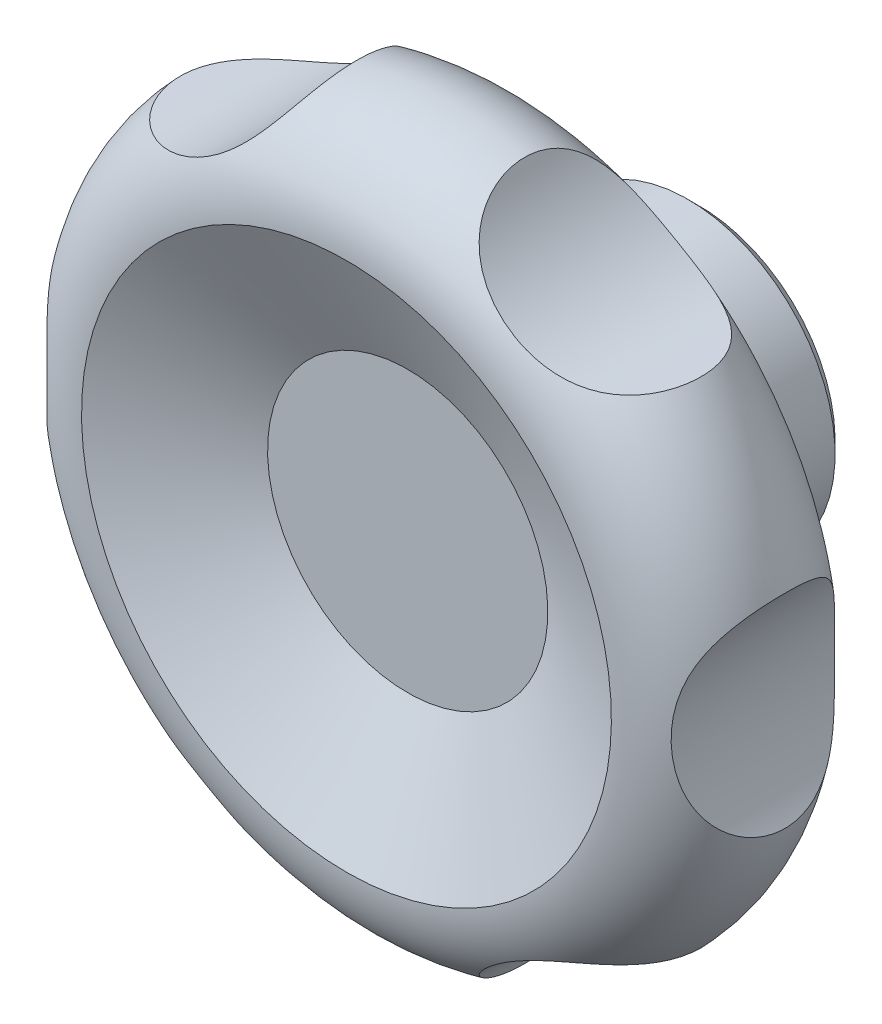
ISO-10303-21;
HEADER;
FILE_DESCRIPTION(('STEP AP214'),'2;1');
FILE_NAME('part.step','',(''),(''),'','','');
FILE_SCHEMA(('AUTOMOTIVE_DESIGN { 1 0 10303 214 1 1 1 1 }'));
ENDSEC;
DATA;
#1=APPLICATION_CONTEXT('core data for automotive mechanical design processes');
#2=APPLICATION_PROTOCOL_DEFINITION('international standard','automotive_design',2000,#1);
#3=PRODUCT_CONTEXT('',#1,'mechanical');
#4=PRODUCT('Part','Part','',(#3));
#5=PRODUCT_RELATED_PRODUCT_CATEGORY('part','',(#4));
#6=PRODUCT_DEFINITION_FORMATION('','',#4);
#7=PRODUCT_DEFINITION_CONTEXT('part definition',#1,'design');
#8=PRODUCT_DEFINITION('design','',#6,#7);
#9=PRODUCT_DEFINITION_SHAPE('','',#8);
#10=(LENGTH_UNIT() NAMED_UNIT(*) SI_UNIT(.MILLI.,.METRE.));
#11=(NAMED_UNIT(*) PLANE_ANGLE_UNIT() SI_UNIT($,.RADIAN.));
#12=(NAMED_UNIT(*) SI_UNIT($,.STERADIAN.) SOLID_ANGLE_UNIT());
#13=UNCERTAINTY_MEASURE_WITH_UNIT(LENGTH_MEASURE(1.E-05),#10,'distance_accuracy_value','');
#14=(GEOMETRIC_REPRESENTATION_CONTEXT(3) GLOBAL_UNCERTAINTY_ASSIGNED_CONTEXT((#13)) GLOBAL_UNIT_ASSIGNED_CONTEXT((#10,
#11,#12)) REPRESENTATION_CONTEXT('',''));
#15=CARTESIAN_POINT('',(0.,0.,0.));
#16=DIRECTION('',(0.,0.,1.));
#17=DIRECTION('',(1.,0.,0.));
#18=AXIS2_PLACEMENT_3D('',#15,#16,#17);
#19=CARTESIAN_POINT('',(0.,0.,22.));
#20=DIRECTION('',(0.,0.,-1.));
#21=DIRECTION('',(0.499999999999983,0.866025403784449,0.));
#22=AXIS2_PLACEMENT_3D('',#19,#20,#21);
#23=TOROIDAL_SURFACE('',#22,22.5000006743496,8.);
#24=CARTESIAN_POINT('',(27.9193279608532,6.36909306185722,16.8675263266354));
#25=CARTESIAN_POINT('',(27.8407054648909,6.20144295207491,16.7312973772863));
#26=CARTESIAN_POINT('',(27.7623794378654,6.02632638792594,16.6039952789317));
#27=CARTESIAN_POINT('',(27.6087153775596,5.66313888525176,16.3671168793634));
#28=CARTESIAN_POINT('',(27.5333797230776,5.47505794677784,16.2575544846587));
#29=CARTESIAN_POINT('',(27.3875698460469,5.08746671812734,16.0552189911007));
#30=CARTESIAN_POINT('',(27.3171118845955,4.88792190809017,15.9625005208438));
#31=CARTESIAN_POINT('',(27.1830207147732,4.47997850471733,15.7932073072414));
#32=CARTESIAN_POINT('',(27.1193863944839,4.27158136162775,15.7166299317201));
#33=CARTESIAN_POINT('',(27.0008703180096,3.85002150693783,15.5790378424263));
#34=CARTESIAN_POINT('',(26.9459007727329,3.63693543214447,15.5178626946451));
#35=CARTESIAN_POINT('',(26.8448079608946,3.20538169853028,15.4086826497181));
#36=CARTESIAN_POINT('',(26.7986848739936,2.98691393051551,15.3606780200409));
#37=CARTESIAN_POINT('',(26.7159541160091,2.54603158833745,15.2766258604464));
#38=CARTESIAN_POINT('',(26.6793424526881,2.32361871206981,15.2405733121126));
#39=CARTESIAN_POINT('',(26.6160454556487,1.87590750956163,15.1793498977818));
#40=CARTESIAN_POINT('',(26.5893607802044,1.65060899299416,15.1541797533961));
#41=CARTESIAN_POINT('',(26.5417650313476,1.15162723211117,15.1097778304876));
#42=CARTESIAN_POINT('',(26.5231677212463,0.877516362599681,15.092829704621));
#43=CARTESIAN_POINT('',(26.5010696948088,0.328160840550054,15.0727389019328));
#44=CARTESIAN_POINT('',(26.4975712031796,0.0529160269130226,15.0695982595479));
#45=CARTESIAN_POINT('',(26.5057214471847,-0.497379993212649,15.0769726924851));
#46=CARTESIAN_POINT('',(26.5173816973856,-0.77243089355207,15.0874981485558));
#47=CARTESIAN_POINT('',(26.5557174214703,-1.32055827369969,15.1227482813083));
#48=CARTESIAN_POINT('',(26.5823912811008,-1.59363496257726,15.1474714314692));
#49=CARTESIAN_POINT('',(26.6478209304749,-2.11583296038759,15.2098713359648));
#50=CARTESIAN_POINT('',(26.6855236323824,-2.365218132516,15.2464407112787));
#51=CARTESIAN_POINT('',(26.7729112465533,-2.85933258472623,15.334117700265));
#52=CARTESIAN_POINT('',(26.8225965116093,-3.10406172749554,15.3852257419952));
#53=CARTESIAN_POINT('',(26.9330149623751,-3.58665870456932,15.5035610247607));
#54=CARTESIAN_POINT('',(26.9937309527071,-3.82453655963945,15.5707632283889));
#55=CARTESIAN_POINT('',(27.1250076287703,-4.29166568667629,15.7231421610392));
#56=CARTESIAN_POINT('',(27.1955656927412,-4.52091923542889,15.8083141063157));
#57=CARTESIAN_POINT('',(27.3288725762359,-4.92073725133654,15.9781267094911));
#58=CARTESIAN_POINT('',(27.3900875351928,-5.09340835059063,16.0590226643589));
#59=CARTESIAN_POINT('',(27.5164016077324,-5.43059505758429,16.2337187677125));
#60=CARTESIAN_POINT('',(27.5814998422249,-5.59511249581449,16.3275160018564));
#61=CARTESIAN_POINT('',(27.7142393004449,-5.91461948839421,16.5284794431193));
#62=CARTESIAN_POINT('',(27.7818796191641,-6.06961238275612,16.6356409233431));
#63=CARTESIAN_POINT('',(27.9181979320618,-6.36880529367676,16.8635536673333));
#64=CARTESIAN_POINT('',(27.9868759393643,-6.51300517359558,16.9843051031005));
#65=CARTESIAN_POINT('',(28.1240267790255,-6.79024437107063,17.2400522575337));
#66=CARTESIAN_POINT('',(28.1924954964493,-6.92320648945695,17.375134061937));
#67=CARTESIAN_POINT('',(28.3269925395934,-7.17581780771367,17.6583564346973));
#68=CARTESIAN_POINT('',(28.3930208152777,-7.29546673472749,17.8064972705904));
#69=CARTESIAN_POINT('',(28.5208520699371,-7.52053718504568,18.1149165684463));
#70=CARTESIAN_POINT('',(28.5826551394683,-7.62595901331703,18.275194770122));
#71=CARTESIAN_POINT('',(28.7003500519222,-7.82189449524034,18.6066555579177));
#72=CARTESIAN_POINT('',(28.7562424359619,-7.91240951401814,18.7778371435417));
#73=CARTESIAN_POINT('',(28.855099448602,-8.06933460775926,19.1110497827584));
#74=CARTESIAN_POINT('',(28.8988058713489,-8.13728035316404,19.2721406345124));
#75=CARTESIAN_POINT('',(28.9793600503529,-8.26069063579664,19.6006922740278));
#76=CARTESIAN_POINT('',(29.0162080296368,-8.31615557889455,19.7681528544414));
#77=CARTESIAN_POINT('',(29.0822742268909,-8.4144873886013,20.1081727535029));
#78=CARTESIAN_POINT('',(29.1114934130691,-8.45735585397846,20.2807314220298));
#79=CARTESIAN_POINT('',(29.1617155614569,-8.53045758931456,20.6296801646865));
#80=CARTESIAN_POINT('',(29.1827184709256,-8.56069077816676,20.8060702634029));
#81=CARTESIAN_POINT('',(29.2156889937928,-8.60793308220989,21.1570929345));
#82=CARTESIAN_POINT('',(29.2278614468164,-8.62524229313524,21.3316660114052));
#83=CARTESIAN_POINT('',(29.2437584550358,-8.64781678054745,21.682046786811));
#84=CARTESIAN_POINT('',(29.2474794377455,-8.65307696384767,21.8578549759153));
#85=CARTESIAN_POINT('',(29.2463936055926,-8.65153923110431,22.2093891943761));
#86=CARTESIAN_POINT('',(29.2415869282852,-8.64474150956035,22.3851152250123));
#87=CARTESIAN_POINT('',(29.2235394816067,-8.6190928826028,22.7351708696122));
#88=CARTESIAN_POINT('',(29.2103024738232,-8.60024735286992,22.9095010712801));
#89=CARTESIAN_POINT('',(29.1755700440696,-8.55040069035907,23.2563640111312));
#90=CARTESIAN_POINT('',(29.1540389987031,-8.51934711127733,23.42888565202));
#91=CARTESIAN_POINT('',(29.103135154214,-8.44510304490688,23.7701189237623));
#92=CARTESIAN_POINT('',(29.0737623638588,-8.40191257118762,23.9388305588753));
#93=CARTESIAN_POINT('',(29.0077543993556,-8.30345163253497,24.2712058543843));
#94=CARTESIAN_POINT('',(28.9711203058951,-8.24818296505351,24.4348702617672));
#95=CARTESIAN_POINT('',(28.8913197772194,-8.12567062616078,24.7560061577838));
#96=CARTESIAN_POINT('',(28.8481533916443,-8.05842704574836,24.9134776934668));
#97=CARTESIAN_POINT('',(28.756363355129,-7.91246618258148,25.2204823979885));
#98=CARTESIAN_POINT('',(28.7077633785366,-7.83379825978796,25.370046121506));
#99=CARTESIAN_POINT('',(28.6059616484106,-7.66508163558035,25.6609574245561));
#100=CARTESIAN_POINT('',(28.5527599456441,-7.5750330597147,25.8023050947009));
#101=CARTESIAN_POINT('',(28.442866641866,-7.38399643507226,26.0759202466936));
#102=CARTESIAN_POINT('',(28.3861755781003,-7.28301006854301,26.2081891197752));
#103=CARTESIAN_POINT('',(28.270465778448,-7.07064644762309,26.4630034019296));
#104=CARTESIAN_POINT('',(28.2114470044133,-6.95926902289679,26.5855486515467));
#105=CARTESIAN_POINT('',(28.0913785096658,-6.72506063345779,26.8222188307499));
#106=CARTESIAN_POINT('',(28.0303115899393,-6.60208248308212,26.9361892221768));
#107=CARTESIAN_POINT('',(27.9082113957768,-6.34691214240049,27.1534198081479));
#108=CARTESIAN_POINT('',(27.8471781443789,-6.21471630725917,27.2566757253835));
#109=CARTESIAN_POINT('',(27.7263120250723,-5.94203319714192,27.4524292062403));
#110=CARTESIAN_POINT('',(27.6664794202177,-5.80154413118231,27.5449244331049));
#111=CARTESIAN_POINT('',(27.5490932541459,-5.51329560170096,27.7193024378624));
#112=CARTESIAN_POINT('',(27.4915392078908,-5.36553770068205,27.8011874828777));
#113=CARTESIAN_POINT('',(27.3596785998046,-5.00988094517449,27.9820963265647));
#114=CARTESIAN_POINT('',(27.2867036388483,-4.7993006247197,28.0768414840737));
#115=CARTESIAN_POINT('',(27.1484886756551,-4.36867417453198,28.248851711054));
#116=CARTESIAN_POINT('',(27.0832509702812,-4.14862526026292,28.3261115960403));
#117=CARTESIAN_POINT('',(26.9618237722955,-3.70072525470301,28.4647990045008));
#118=CARTESIAN_POINT('',(26.9056510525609,-3.47286062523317,28.5261973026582));
#119=CARTESIAN_POINT('',(26.8035156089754,-3.01151153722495,28.6345352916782));
#120=CARTESIAN_POINT('',(26.7575532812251,-2.77802686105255,28.681474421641));
#121=CARTESIAN_POINT('',(26.6663028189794,-2.24744158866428,28.772539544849));
#122=CARTESIAN_POINT('',(26.6241164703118,-1.94916673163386,28.8129612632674));
#123=CARTESIAN_POINT('',(26.5577008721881,-1.34870880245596,28.8755678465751));
#124=CARTESIAN_POINT('',(26.5334761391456,-1.04652476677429,28.8977481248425));
#125=CARTESIAN_POINT('',(26.5033800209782,-0.440085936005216,28.9251931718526));
#126=CARTESIAN_POINT('',(26.4975329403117,-0.135828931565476,28.9304355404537));
#127=CARTESIAN_POINT('',(26.5043538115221,0.472283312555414,28.9242654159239));
#128=CARTESIAN_POINT('',(26.5170201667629,0.776138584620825,28.9128543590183));
#129=CARTESIAN_POINT('',(26.5608278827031,1.38368262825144,28.8725300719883));
#130=CARTESIAN_POINT('',(26.592107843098,1.68735286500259,28.8434855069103));
#131=CARTESIAN_POINT('',(26.672702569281,2.28989494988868,28.7660657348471));
#132=CARTESIAN_POINT('',(26.7220202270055,2.58876602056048,28.7176874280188));
#133=CARTESIAN_POINT('',(26.8374566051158,3.17800052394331,28.5992268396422));
#134=CARTESIAN_POINT('',(26.9035270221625,3.46838578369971,28.5292068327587));
#135=CARTESIAN_POINT('',(27.050758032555,4.03804102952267,28.3643683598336));
#136=CARTESIAN_POINT('',(27.1319093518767,4.3173177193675,28.2695651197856));
#137=CARTESIAN_POINT('',(27.2767696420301,4.76814833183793,28.0891504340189));
#138=CARTESIAN_POINT('',(27.3370062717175,4.94399643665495,28.0114047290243));
#139=CARTESIAN_POINT('',(27.4617527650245,5.28781709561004,27.843039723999));
#140=CARTESIAN_POINT('',(27.5262613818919,5.45579192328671,27.752424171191));
#141=CARTESIAN_POINT('',(27.658241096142,5.78245071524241,27.5577895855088));
#142=CARTESIAN_POINT('',(27.7257106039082,5.9411395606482,27.4537776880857));
#143=CARTESIAN_POINT('',(27.8621439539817,6.24796550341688,27.2320214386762));
#144=CARTESIAN_POINT('',(27.9311078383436,6.39610230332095,27.114276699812));
#145=CARTESIAN_POINT('',(28.0693247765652,6.68148777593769,26.8642672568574));
#146=CARTESIAN_POINT('',(28.1385765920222,6.81865524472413,26.7319089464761));
#147=CARTESIAN_POINT('',(28.2750850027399,7.07978388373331,26.4537863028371));
#148=CARTESIAN_POINT('',(28.3423415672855,7.2037448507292,26.3080217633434));
#149=CARTESIAN_POINT('',(28.4730309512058,7.43747380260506,26.0039281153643));
#150=CARTESIAN_POINT('',(28.5364637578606,7.54724174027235,25.845598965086));
#151=CARTESIAN_POINT('',(28.6577524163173,7.7518275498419,25.5175611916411));
#152=CARTESIAN_POINT('',(28.7156087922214,7.84664682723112,25.3478536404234));
#153=CARTESIAN_POINT('',(28.8183494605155,8.01150052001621,25.0172154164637));
#154=CARTESIAN_POINT('',(28.8639593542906,8.08310122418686,24.8572879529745));
#155=CARTESIAN_POINT('',(28.9484895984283,8.21374731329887,24.5306791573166));
#156=CARTESIAN_POINT('',(28.9874101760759,8.27279312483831,24.3639980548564));
#157=CARTESIAN_POINT('',(29.0577346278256,8.37818889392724,24.0251550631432));
#158=CARTESIAN_POINT('',(29.0891394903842,8.42454052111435,23.8529938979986));
#159=CARTESIAN_POINT('',(29.1437923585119,8.50449770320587,23.5044667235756));
#160=CARTESIAN_POINT('',(29.1670403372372,8.53810321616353,23.3281007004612));
#161=CARTESIAN_POINT('',(29.2043682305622,8.59176791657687,22.9775872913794));
#162=CARTESIAN_POINT('',(29.2186913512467,8.61218706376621,22.8035207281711));
#163=CARTESIAN_POINT('',(29.2389337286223,8.64098172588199,22.4538525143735));
#164=CARTESIAN_POINT('',(29.2448503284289,8.64935343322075,22.2782503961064));
#165=CARTESIAN_POINT('',(29.248160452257,8.65404159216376,21.9268454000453));
#166=CARTESIAN_POINT('',(29.2455559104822,8.65036077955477,21.7510425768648));
#167=CARTESIAN_POINT('',(29.2318764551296,8.6309492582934,21.4004345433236));
#168=CARTESIAN_POINT('',(29.2208015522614,8.61521856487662,21.2256293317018));
#169=CARTESIAN_POINT('',(29.1903232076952,8.57161402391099,20.8775124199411));
#170=CARTESIAN_POINT('',(29.1708845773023,8.54368886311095,20.7042102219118));
#171=CARTESIAN_POINT('',(29.124051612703,8.47570660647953,20.3611555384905));
#172=CARTESIAN_POINT('',(29.0966599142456,8.43565352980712,20.1914018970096));
#173=CARTESIAN_POINT('',(29.0344412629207,8.34343677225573,19.8565541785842));
#174=CARTESIAN_POINT('',(28.9996120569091,8.29126942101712,19.6914615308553));
#175=CARTESIAN_POINT('',(28.9232170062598,8.17492315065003,19.3671782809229));
#176=CARTESIAN_POINT('',(28.8816513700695,8.1107446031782,19.2079874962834));
#177=CARTESIAN_POINT('',(28.7927771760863,7.97077990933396,18.897146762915));
#178=CARTESIAN_POINT('',(28.745488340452,7.89503340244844,18.745473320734));
#179=CARTESIAN_POINT('',(28.6460299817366,7.73204777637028,18.4501144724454));
#180=CARTESIAN_POINT('',(28.5938604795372,7.64480870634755,18.3064290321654));
#181=CARTESIAN_POINT('',(28.4857948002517,7.45935395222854,18.028113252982));
#182=CARTESIAN_POINT('',(28.4299035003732,7.36115252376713,17.8934715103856));
#183=CARTESIAN_POINT('',(28.3155085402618,7.15423968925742,17.6337997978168));
#184=CARTESIAN_POINT('',(28.2570058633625,7.04553222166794,17.5087662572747));
#185=CARTESIAN_POINT('',(28.1518662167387,6.84377095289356,17.2957331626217));
#186=CARTESIAN_POINT('',(28.1055138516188,6.75268157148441,17.2057210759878));
#187=CARTESIAN_POINT('',(28.0125155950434,6.56496308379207,17.0319404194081));
#188=CARTESIAN_POINT('',(27.9658698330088,6.46833628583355,16.9481692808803));
#189=CARTESIAN_POINT('',(27.9193279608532,6.36909306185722,16.8675263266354));
#190=B_SPLINE_CURVE_WITH_KNOTS('',3,(#24,#25,#26,#27,#28,#29,#30,#31,#32,#33,#34,#35,#36,#37,
#38,#39,#40,#41,#42,#43,#44,#45,#46,#47,#48,#49,#50,#51,#52,#53,#54,#55,#56,#57,#58,#59,#60,#61,
#62,#63,#64,#65,#66,#67,#68,#69,#70,#71,#72,#73,#74,#75,#76,#77,#78,#79,#80,#81,#82,#83,#84,#85,
#86,#87,#88,#89,#90,#91,#92,#93,#94,#95,#96,#97,#98,#99,#100,#101,#102,#103,#104,#105,#106,#107,
#108,#109,#110,#111,#112,#113,#114,#115,#116,#117,#118,#119,#120,#121,#122,#123,#124,#125,#126,
#127,#128,#129,#130,#131,#132,#133,#134,#135,#136,#137,#138,#139,#140,#141,#142,#143,#144,#145,
#146,#147,#148,#149,#150,#151,#152,#153,#154,#155,#156,#157,#158,#159,#160,#161,#162,#163,#164,
#165,#166,#167,#168,#169,#170,#171,#172,#173,#174,#175,#176,#177,#178,#179,#180,#181,#182,#183,
#184,#185,#186,#187,#188,#189),.UNSPECIFIED.,.T.,.F.,(4,2,2,2,2,2,2,2,2,2,2,2,2,2,2,2,2,2,2,2,2,
2,2,2,2,2,2,2,2,2,2,2,2,2,2,2,2,2,2,2,2,2,2,2,2,2,2,2,2,2,2,2,2,2,2,2,2,2,2,2,2,2,2,2,2,2,2,2,2,
2,2,2,2,2,2,2,2,2,2,2,2,2,4),(0.,0.689481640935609,1.37950119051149,2.07172015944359,
2.7638261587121,3.44839322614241,4.13297419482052,4.81726735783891,5.50160588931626,
6.32659183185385,7.1516993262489,7.97743393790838,8.80307978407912,9.56696125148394,
10.3308652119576,11.0935884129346,11.8561088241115,12.4563467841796,13.0564493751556,
13.6563403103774,14.2562388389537,14.8599704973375,15.4637145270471,16.0674456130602,
16.6711213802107,17.2111028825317,17.7510668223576,18.2909621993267,18.8308610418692,
19.357796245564,19.8849541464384,20.4121035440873,20.9390178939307,21.4682210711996,
21.9974236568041,22.5265475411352,23.0556674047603,23.5825656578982,24.1094580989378,
24.6362696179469,25.1630897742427,25.6978409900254,26.232804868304,26.7678847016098,
27.3028500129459,28.0282922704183,28.7539493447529,29.4809340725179,30.2079469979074,
31.1185661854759,32.0294142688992,32.9414664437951,33.8534399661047,34.7722906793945,
35.6912887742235,36.6076666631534,37.5234828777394,38.1273969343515,38.7311355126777,
39.3345538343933,39.9379891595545,40.5455425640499,41.1531053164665,41.7606700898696,
42.3681777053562,42.9106962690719,43.4531963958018,43.9956251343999,44.5380556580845,
45.0649716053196,45.5920540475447,46.119016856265,46.6459789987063,47.1751802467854,
47.704206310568,48.2333928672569,48.762563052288,49.2899590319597,49.8173527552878,
50.3440684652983,50.8705874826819,51.2789064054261,51.6870563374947),.UNSPECIFIED.);
#191=CARTESIAN_POINT('',(27.9193279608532,6.36909306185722,16.8675263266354));
#192=VERTEX_POINT('',#191);
#193=EDGE_CURVE('E9',#192,#192,#190,.T.);
#194=ORIENTED_EDGE('',*,*,#193,.T.);
#195=EDGE_LOOP('',(#194));
#196=FACE_BOUND('',#195,.T.);
#197=CARTESIAN_POINT('',(8.6303061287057,27.1018993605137,16.6443782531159));
#198=CARTESIAN_POINT('',(8.74759707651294,26.9410619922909,16.5138117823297));
#199=CARTESIAN_POINT('',(8.87181367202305,26.7774737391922,16.3928429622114));
#200=CARTESIAN_POINT('',(9.13341671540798,26.4479892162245,16.1695283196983));
#201=CARTESIAN_POINT('',(9.27081199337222,26.2820914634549,16.0671951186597));
#202=CARTESIAN_POINT('',(9.55819324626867,25.9504727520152,15.8799032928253));
#203=CARTESIAN_POINT('',(9.7082141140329,25.7847536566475,15.7949952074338));
#204=CARTESIAN_POINT('',(10.0194685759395,25.4564062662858,15.641538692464));
#205=CARTESIAN_POINT('',(10.180700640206,25.2937775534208,15.5729880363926));
#206=CARTESIAN_POINT('',(10.5115707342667,24.9752589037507,15.4513840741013));
#207=CARTESIAN_POINT('',(10.6810983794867,24.8193149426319,15.3981704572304));
#208=CARTESIAN_POINT('',(11.0292085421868,24.5137749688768,15.3048508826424));
#209=CARTESIAN_POINT('',(11.2077911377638,24.3641790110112,15.2647450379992));
#210=CARTESIAN_POINT('',(11.5730922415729,24.0724938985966,15.1964285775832));
#211=CARTESIAN_POINT('',(11.7598090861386,23.9304032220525,15.1682155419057));
#212=CARTESIAN_POINT('',(12.1405885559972,23.6545618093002,15.1227278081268));
#213=CARTESIAN_POINT('',(12.3346517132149,23.5208116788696,15.105453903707));
#214=CARTESIAN_POINT('',(12.7710235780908,23.2350338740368,15.0786598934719));
#215=CARTESIAN_POINT('',(13.0148655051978,23.085111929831,15.071547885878));
#216=CARTESIAN_POINT('',(13.5107545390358,22.7994595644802,15.0720580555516));
#217=CARTESIAN_POINT('',(13.7628030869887,22.6637316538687,15.0796828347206));
#218=CARTESIAN_POINT('',(14.273604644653,22.407205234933,15.1100933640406));
#219=CARTESIAN_POINT('',(14.5323596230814,22.2864111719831,15.132883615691));
#220=CARTESIAN_POINT('',(15.0546623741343,22.0604273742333,15.194816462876));
#221=CARTESIAN_POINT('',(15.3182091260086,21.9552343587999,15.2339556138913));
#222=CARTESIAN_POINT('',(15.8042099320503,21.7769086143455,15.3225016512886));
#223=CARTESIAN_POINT('',(16.0262775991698,21.7013493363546,15.3691530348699));
#224=CARTESIAN_POINT('',(16.4706072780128,21.5615629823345,15.4765434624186));
#225=CARTESIAN_POINT('',(16.6928692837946,21.4973355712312,15.5372820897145));
#226=CARTESIAN_POINT('',(17.1352442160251,21.3803220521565,15.674232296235));
#227=CARTESIAN_POINT('',(17.3553600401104,21.3275175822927,15.7504186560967));
#228=CARTESIAN_POINT('',(17.791407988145,21.2330335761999,15.9197955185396));
#229=CARTESIAN_POINT('',(18.0073409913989,21.1913516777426,16.0129824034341));
#230=CARTESIAN_POINT('',(18.3926132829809,21.125415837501,16.1985164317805));
#231=CARTESIAN_POINT('',(18.5631325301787,21.0993614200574,16.2877798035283));
#232=CARTESIAN_POINT('',(18.8979005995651,21.0538779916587,16.4788483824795));
#233=CARTESIAN_POINT('',(19.0621506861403,21.0344476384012,16.5806510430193));
#234=CARTESIAN_POINT('',(19.3826377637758,21.0016383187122,16.7970156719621));
#235=CARTESIAN_POINT('',(19.5388760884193,20.9882583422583,16.9115755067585));
#236=CARTESIAN_POINT('',(19.8416145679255,20.9668158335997,17.1533899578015));
#237=CARTESIAN_POINT('',(19.9881145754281,20.9587533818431,17.2806447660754));
#238=CARTESIAN_POINT('',(20.270379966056,20.9470550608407,17.5481010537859));
#239=CARTESIAN_POINT('',(20.4060883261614,20.9434414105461,17.6883637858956));
#240=CARTESIAN_POINT('',(20.6643830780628,20.9397421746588,17.9805511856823));
#241=CARTESIAN_POINT('',(20.786969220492,20.9396566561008,18.1324760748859));
#242=CARTESIAN_POINT('',(21.0176542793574,20.9419984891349,18.4469530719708));
#243=CARTESIAN_POINT('',(21.1257523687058,20.94442598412,18.6095057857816));
#244=CARTESIAN_POINT('',(21.3263194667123,20.9507936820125,18.9439490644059));
#245=CARTESIAN_POINT('',(21.4187895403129,20.9547337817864,19.1158389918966));
#246=CARTESIAN_POINT('',(21.5799545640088,20.962834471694,19.452327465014));
#247=CARTESIAN_POINT('',(21.650012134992,20.966946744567,19.6162764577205));
#248=CARTESIAN_POINT('',(21.7758436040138,20.9750409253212,19.9495710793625));
#249=CARTESIAN_POINT('',(21.8316177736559,20.9790228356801,20.1189166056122));
#250=CARTESIAN_POINT('',(21.9285077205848,20.9863429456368,20.4617413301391));
#251=CARTESIAN_POINT('',(21.9696251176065,20.9896812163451,20.6352200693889));
#252=CARTESIAN_POINT('',(22.0369629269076,20.9953270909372,20.9850635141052));
#253=CARTESIAN_POINT('',(22.0631831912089,20.9976346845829,21.1614282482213));
#254=CARTESIAN_POINT('',(22.1003320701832,21.0009463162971,21.5134252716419));
#255=CARTESIAN_POINT('',(22.1114572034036,21.0019670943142,21.6890367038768));
#256=CARTESIAN_POINT('',(22.1189983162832,21.0026562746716,22.0406531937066));
#257=CARTESIAN_POINT('',(22.1154080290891,21.0023241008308,22.2166583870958));
#258=CARTESIAN_POINT('',(22.0935228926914,21.0003398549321,22.5677421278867));
#259=CARTESIAN_POINT('',(22.075228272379,20.9986878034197,22.74282068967));
#260=CARTESIAN_POINT('',(22.024044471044,20.9942364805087,23.0907367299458));
#261=CARTESIAN_POINT('',(21.9911618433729,20.9914377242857,23.2635751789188));
#262=CARTESIAN_POINT('',(21.9108487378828,20.9849863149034,23.606464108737));
#263=CARTESIAN_POINT('',(21.8633675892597,20.9813306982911,23.7765026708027));
#264=CARTESIAN_POINT('',(21.754189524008,20.9736052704,24.1119436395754));
#265=CARTESIAN_POINT('',(21.69249263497,20.9695354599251,24.2773460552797));
#266=CARTESIAN_POINT('',(21.5553107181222,20.9615299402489,24.602301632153));
#267=CARTESIAN_POINT('',(21.4798280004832,20.9575942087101,24.7618557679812));
#268=CARTESIAN_POINT('',(21.3156270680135,20.950497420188,25.0740175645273));
#269=CARTESIAN_POINT('',(21.2269089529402,20.9473363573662,25.2266252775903));
#270=CARTESIAN_POINT('',(21.0373732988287,20.9425091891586,25.5232070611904));
#271=CARTESIAN_POINT('',(20.936610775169,20.9408365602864,25.6672161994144));
#272=CARTESIAN_POINT('',(20.7235490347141,20.9396994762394,25.9464327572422));
#273=CARTESIAN_POINT('',(20.6112499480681,20.9402349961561,26.0816402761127));
#274=CARTESIAN_POINT('',(20.3761607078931,20.9442529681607,26.3425030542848));
#275=CARTESIAN_POINT('',(20.2533725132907,20.9477348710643,26.4681600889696));
#276=CARTESIAN_POINT('',(19.9984340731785,20.9583513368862,26.7094276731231));
#277=CARTESIAN_POINT('',(19.8662830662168,20.9654861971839,26.8250374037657));
#278=CARTESIAN_POINT('',(19.5904790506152,20.9842833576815,27.0486403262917));
#279=CARTESIAN_POINT('',(19.4466213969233,20.9960541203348,27.156371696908));
#280=CARTESIAN_POINT('',(19.1517972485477,21.0247036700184,27.3608388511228));
#281=CARTESIAN_POINT('',(19.0008307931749,21.0415824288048,27.4575746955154));
#282=CARTESIAN_POINT('',(18.6931082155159,21.0809405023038,27.6402307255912));
#283=CARTESIAN_POINT('',(18.5363493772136,21.1034224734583,27.7261457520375));
#284=CARTESIAN_POINT('',(18.2184374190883,21.1543473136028,27.8874486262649));
#285=CARTESIAN_POINT('',(18.0572835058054,21.1827912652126,27.9628345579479));
#286=CARTESIAN_POINT('',(17.6671739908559,21.2584415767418,28.1315098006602));
#287=CARTESIAN_POINT('',(17.4367125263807,21.3086128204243,28.2200168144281));
#288=CARTESIAN_POINT('',(16.9726586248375,21.4214874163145,28.3790341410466));
#289=CARTESIAN_POINT('',(16.7390651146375,21.4841951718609,28.4495381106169));
#290=CARTESIAN_POINT('',(16.2709892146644,21.6223000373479,28.5743788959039));
#291=CARTESIAN_POINT('',(16.0365060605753,21.6977136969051,28.6286943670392));
#292=CARTESIAN_POINT('',(15.5690174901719,21.8610365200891,28.7227033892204));
#293=CARTESIAN_POINT('',(15.3360119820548,21.948944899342,28.7623978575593));
#294=CARTESIAN_POINT('',(14.8688345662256,22.1387270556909,28.8291939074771));
#295=CARTESIAN_POINT('',(14.6347203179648,22.2408283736,28.8560498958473));
#296=CARTESIAN_POINT('',(14.1711317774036,22.4573264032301,28.8971574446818));
#297=CARTESIAN_POINT('',(13.9416575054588,22.5717231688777,28.9114089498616));
#298=CARTESIAN_POINT('',(13.4883440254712,22.8124395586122,28.9279281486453));
#299=CARTESIAN_POINT('',(13.2645100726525,22.9387698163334,28.9301850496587));
#300=CARTESIAN_POINT('',(12.8237601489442,23.2026793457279,28.9227828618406));
#301=CARTESIAN_POINT('',(12.6068448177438,23.3402596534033,28.9131226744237));
#302=CARTESIAN_POINT('',(12.1377378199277,23.6549402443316,28.8782609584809));
#303=CARTESIAN_POINT('',(11.8873172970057,23.8343955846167,28.850304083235));
#304=CARTESIAN_POINT('',(11.3997387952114,24.2069068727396,28.7748703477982));
#305=CARTESIAN_POINT('',(11.1625844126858,24.3999664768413,28.7273882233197));
#306=CARTESIAN_POINT('',(10.704014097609,24.7968983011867,28.6104559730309));
#307=CARTESIAN_POINT('',(10.4825668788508,25.0007475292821,28.5410511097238));
#308=CARTESIAN_POINT('',(10.0570770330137,25.4162886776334,28.377127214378));
#309=CARTESIAN_POINT('',(9.85302309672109,25.6279753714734,28.2826246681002));
#310=CARTESIAN_POINT('',(9.53157686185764,25.9809988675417,28.1028734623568));
#311=CARTESIAN_POINT('',(9.40858808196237,26.121390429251,28.0256951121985));
#312=CARTESIAN_POINT('',(9.17157738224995,26.4020348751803,27.8584430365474));
#313=CARTESIAN_POINT('',(9.05755284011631,26.5422877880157,27.7683731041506));
#314=CARTESIAN_POINT('',(8.83907318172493,26.8207816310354,27.5748106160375));
#315=CARTESIAN_POINT('',(8.73461098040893,26.9590239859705,27.4713281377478));
#316=CARTESIAN_POINT('',(8.5355953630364,27.2316215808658,27.2505771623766));
#317=CARTESIAN_POINT('',(8.44104221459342,27.365976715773,27.1333082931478));
#318=CARTESIAN_POINT('',(8.26152290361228,27.6296056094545,26.884158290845));
#319=CARTESIAN_POINT('',(8.1766285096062,27.7588371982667,26.7521805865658));
#320=CARTESIAN_POINT('',(8.01732734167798,28.0090359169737,26.4747230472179));
#321=CARTESIAN_POINT('',(7.94292073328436,28.130002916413,26.329242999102));
#322=CARTESIAN_POINT('',(7.804540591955,28.3615789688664,26.0256036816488));
#323=CARTESIAN_POINT('',(7.74056755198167,28.4721875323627,25.8674438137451));
#324=CARTESIAN_POINT('',(7.62284279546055,28.6811195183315,25.53962991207));
#325=CARTESIAN_POINT('',(7.56909009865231,28.7794441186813,25.369976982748));
#326=CARTESIAN_POINT('',(7.47674817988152,28.9522562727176,25.0395629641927));
#327=CARTESIAN_POINT('',(7.43714726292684,29.028172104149,24.8798283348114));
#328=CARTESIAN_POINT('',(7.3655021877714,29.1679503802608,24.5535360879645));
#329=CARTESIAN_POINT('',(7.33345776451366,29.2318132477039,24.386978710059));
#330=CARTESIAN_POINT('',(7.27663299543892,29.346687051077,24.0483171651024));
#331=CARTESIAN_POINT('',(7.25185157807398,29.3976998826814,23.8762138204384));
#332=CARTESIAN_POINT('',(7.20927290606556,29.4862857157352,23.5277356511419));
#333=CARTESIAN_POINT('',(7.19147567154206,29.5238586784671,23.3513608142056));
#334=CARTESIAN_POINT('',(7.16307161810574,29.5842336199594,23.0009330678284));
#335=CARTESIAN_POINT('',(7.15226796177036,29.6074390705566,22.8269654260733));
#336=CARTESIAN_POINT('',(7.13689282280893,29.6405584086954,22.4774397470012));
#337=CARTESIAN_POINT('',(7.13232330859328,29.6504680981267,22.3018812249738));
#338=CARTESIAN_POINT('',(7.12936346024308,29.6568804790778,21.9505034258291));
#339=CARTESIAN_POINT('',(7.13097187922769,29.6533858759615,21.7746842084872));
#340=CARTESIAN_POINT('',(7.14038624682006,29.6330312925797,21.4239878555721));
#341=CARTESIAN_POINT('',(7.14819218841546,29.6161713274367,21.2491107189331));
#342=CARTESIAN_POINT('',(7.17014914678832,29.5691574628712,20.9007867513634));
#343=CARTESIAN_POINT('',(7.18432725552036,29.5389468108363,20.7273492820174));
#344=CARTESIAN_POINT('',(7.21920366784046,29.4655505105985,20.3839693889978));
#345=CARTESIAN_POINT('',(7.23989981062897,29.4223691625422,20.2140258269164));
#346=CARTESIAN_POINT('',(7.28804891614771,29.3234921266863,19.8787650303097));
#347=CARTESIAN_POINT('',(7.31550311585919,29.2677941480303,19.7134486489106));
#348=CARTESIAN_POINT('',(7.37743238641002,29.144527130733,19.38866399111));
#349=CARTESIAN_POINT('',(7.4119072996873,29.0769583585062,19.2291955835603));
#350=CARTESIAN_POINT('',(7.48802132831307,28.9310125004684,18.9177717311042));
#351=CARTESIAN_POINT('',(7.52963506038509,28.8526738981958,18.765792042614));
#352=CARTESIAN_POINT('',(7.62036135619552,28.6859803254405,18.4697741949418));
#353=CARTESIAN_POINT('',(7.66947392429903,28.5976253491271,18.3257360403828));
#354=CARTESIAN_POINT('',(7.77535656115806,28.4121051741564,18.0466125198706));
#355=CARTESIAN_POINT('',(7.83212004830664,28.3149475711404,17.9115196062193));
#356=CARTESIAN_POINT('',(7.95344348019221,28.1130492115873,17.6509139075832));
#357=CARTESIAN_POINT('',(8.01800153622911,28.0083102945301,17.5253988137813));
#358=CARTESIAN_POINT('',(8.16652414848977,27.7743692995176,17.2641036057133));
#359=CARTESIAN_POINT('',(8.25192543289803,27.6440204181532,17.1301618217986));
#360=CARTESIAN_POINT('',(8.43327440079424,27.3770936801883,16.8765666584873));
#361=CARTESIAN_POINT('',(8.52921808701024,27.2405181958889,16.7569078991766));
#362=CARTESIAN_POINT('',(8.6303061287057,27.1018993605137,16.6443782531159));
#363=B_SPLINE_CURVE_WITH_KNOTS('',3,(#197,#198,#199,#200,#201,#202,#203,#204,#205,#206,#207,
#208,#209,#210,#211,#212,#213,#214,#215,#216,#217,#218,#219,#220,#221,#222,#223,#224,#225,#226,
#227,#228,#229,#230,#231,#232,#233,#234,#235,#236,#237,#238,#239,#240,#241,#242,#243,#244,#245,
#246,#247,#248,#249,#250,#251,#252,#253,#254,#255,#256,#257,#258,#259,#260,#261,#262,#263,#264,
#265,#266,#267,#268,#269,#270,#271,#272,#273,#274,#275,#276,#277,#278,#279,#280,#281,#282,#283,
#284,#285,#286,#287,#288,#289,#290,#291,#292,#293,#294,#295,#296,#297,#298,#299,#300,#301,#302,
#303,#304,#305,#306,#307,#308,#309,#310,#311,#312,#313,#314,#315,#316,#317,#318,#319,#320,#321,
#322,#323,#324,#325,#326,#327,#328,#329,#330,#331,#332,#333,#334,#335,#336,#337,#338,#339,#340,
#341,#342,#343,#344,#345,#346,#347,#348,#349,#350,#351,#352,#353,#354,#355,#356,#357,#358,#359,
#360,#361,#362),.UNSPECIFIED.,.T.,.F.,(4,2,2,2,2,2,2,2,2,2,2,2,2,2,2,2,2,2,2,2,2,2,2,2,2,2,2,2,
2,2,2,2,2,2,2,2,2,2,2,2,2,2,2,2,2,2,2,2,2,2,2,2,2,2,2,2,2,2,2,2,2,2,2,2,2,2,2,2,2,2,2,2,2,2,2,2,
2,2,2,2,2,2,4),(0.,0.713928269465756,1.42833827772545,2.1447919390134,2.86114802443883,
3.56971966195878,4.27829741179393,4.98673091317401,5.69521580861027,6.55333204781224,
7.41159980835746,8.27012243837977,9.12846427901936,9.84533663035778,10.5621877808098,
11.2778779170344,11.9934159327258,12.5755243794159,13.1575147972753,13.7394080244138,
14.3213100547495,14.9061066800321,15.4909144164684,16.0757555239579,16.6605567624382,
17.1949258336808,17.7292847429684,18.263584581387,18.7978897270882,19.3251699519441,
19.8526747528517,20.3801713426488,20.9074312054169,21.4365422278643,21.9656522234,
22.4946736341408,23.0236910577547,23.5503783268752,24.0770596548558,24.6036428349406,
25.1302688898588,25.6700272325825,26.2097825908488,26.7497943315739,27.289904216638,
28.044546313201,28.7994539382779,29.5553525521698,30.3112037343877,31.0809865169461,
31.8507726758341,32.6212513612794,33.3918010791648,34.3186756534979,35.245800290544,
36.171023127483,37.0956397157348,37.7010201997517,38.3062229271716,38.9109735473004,
39.5157404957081,40.1247422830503,40.7337536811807,41.3427938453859,41.9517755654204,
42.4948131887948,43.0378317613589,43.580770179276,44.1237101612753,44.6506150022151,
45.1776861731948,45.7046509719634,46.2316151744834,46.7608413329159,47.2898922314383,
47.8190400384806,48.3481759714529,48.8754680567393,49.4027604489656,49.9296021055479,
50.4563163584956,51.0718531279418,51.6871573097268),.UNSPECIFIED.);
#364=CARTESIAN_POINT('',(8.6303061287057,27.1018993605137,16.6443782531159));
#365=VERTEX_POINT('',#364);
#366=EDGE_CURVE('E26',#365,#365,#363,.T.);
#367=ORIENTED_EDGE('',*,*,#366,.T.);
#368=EDGE_LOOP('',(#367));
#369=FACE_BOUND('',#368,.T.);
#370=CARTESIAN_POINT('',(-8.44386758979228,27.3633938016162,16.8675263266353));
#371=CARTESIAN_POINT('',(-8.36103497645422,27.4822373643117,16.9740945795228));
#372=CARTESIAN_POINT('',(-8.28226274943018,27.598944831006,17.0861270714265));
#373=CARTESIAN_POINT('',(-8.13288902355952,27.8266691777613,17.3209786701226));
#374=CARTESIAN_POINT('',(-8.06228796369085,27.9376857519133,17.4437983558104));
#375=CARTESIAN_POINT('',(-7.92929034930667,28.1525391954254,17.6998105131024));
#376=CARTESIAN_POINT('',(-7.8668964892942,28.2563737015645,17.8330063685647));
#377=CARTESIAN_POINT('',(-7.75025173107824,28.4554130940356,18.1090676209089));
#378=CARTESIAN_POINT('',(-7.6960007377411,28.5506180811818,18.2519329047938));
#379=CARTESIAN_POINT('',(-7.59538185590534,28.7312585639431,18.5467031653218));
#380=CARTESIAN_POINT('',(-7.54902695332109,28.8166778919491,18.698622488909));
#381=CARTESIAN_POINT('',(-7.46405743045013,28.9764401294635,19.0102549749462));
#382=CARTESIAN_POINT('',(-7.42544292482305,29.0507828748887,19.1699682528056));
#383=CARTESIAN_POINT('',(-7.35566374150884,29.1874511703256,19.49604604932));
#384=CARTESIAN_POINT('',(-7.324499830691,29.2497754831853,19.6624112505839));
#385=CARTESIAN_POINT('',(-7.2693348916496,29.3616379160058,20.000538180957));
#386=CARTESIAN_POINT('',(-7.24533375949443,29.4111762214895,20.172299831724));
#387=CARTESIAN_POINT('',(-7.20473331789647,29.4958397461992,20.5156658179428));
#388=CARTESIAN_POINT('',(-7.18796695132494,29.5312885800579,20.6871707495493));
#389=CARTESIAN_POINT('',(-7.16079553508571,29.5891059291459,21.0329293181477));
#390=CARTESIAN_POINT('',(-7.15039265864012,29.6114699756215,21.2071838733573));
#391=CARTESIAN_POINT('',(-7.13582717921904,29.6428645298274,21.5571169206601));
#392=CARTESIAN_POINT('',(-7.13166347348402,29.6518973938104,21.7327951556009));
#393=CARTESIAN_POINT('',(-7.12951816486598,29.656545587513,22.084366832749));
#394=CARTESIAN_POINT('',(-7.13153656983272,29.6521609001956,22.2602602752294));
#395=CARTESIAN_POINT('',(-7.1417985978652,29.6299826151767,22.611585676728));
#396=CARTESIAN_POINT('',(-7.15006219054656,29.6121460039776,22.7870143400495));
#397=CARTESIAN_POINT('',(-7.17294088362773,29.5632059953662,23.1355295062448));
#398=CARTESIAN_POINT('',(-7.1875537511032,29.5321072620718,23.3086168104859));
#399=CARTESIAN_POINT('',(-7.22330976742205,29.4569700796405,23.6512869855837));
#400=CARTESIAN_POINT('',(-7.24445339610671,29.4129306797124,23.8208695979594));
#401=CARTESIAN_POINT('',(-7.29350408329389,29.3123968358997,24.1552984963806));
#402=CARTESIAN_POINT('',(-7.32141110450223,29.2559024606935,24.3201448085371));
#403=CARTESIAN_POINT('',(-7.38419673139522,29.1312245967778,24.6436151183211));
#404=CARTESIAN_POINT('',(-7.41906203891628,29.063063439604,24.8022503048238));
#405=CARTESIAN_POINT('',(-7.49607031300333,28.9157928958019,25.1125153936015));
#406=CARTESIAN_POINT('',(-7.53821322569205,28.8366835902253,25.2641453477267));
#407=CARTESIAN_POINT('',(-7.63001958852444,28.6685149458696,25.5593576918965));
#408=CARTESIAN_POINT('',(-7.67968167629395,28.5794574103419,25.7029415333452));
#409=CARTESIAN_POINT('',(-7.78673085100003,28.3925216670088,25.9812064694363));
#410=CARTESIAN_POINT('',(-7.84411794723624,28.2946434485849,26.115887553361));
#411=CARTESIAN_POINT('',(-7.96690996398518,28.0910559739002,26.3759942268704));
#412=CARTESIAN_POINT('',(-8.03233687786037,27.9853255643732,26.5013928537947));
#413=CARTESIAN_POINT('',(-8.17113407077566,27.7676127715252,26.7420457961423));
#414=CARTESIAN_POINT('',(-8.2445076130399,27.6556278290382,26.8572959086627));
#415=CARTESIAN_POINT('',(-8.39909503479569,27.4268763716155,27.0772945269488));
#416=CARTESIAN_POINT('',(-8.48030881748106,27.310109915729,27.1820431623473));
#417=CARTESIAN_POINT('',(-8.65036818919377,27.0732532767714,27.3809378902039));
#418=CARTESIAN_POINT('',(-8.73921152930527,26.9531640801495,27.4750870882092));
#419=CARTESIAN_POINT('',(-8.93064796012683,26.7026608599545,27.6590750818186));
#420=CARTESIAN_POINT('',(-9.03376640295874,26.5721045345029,27.7481727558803));
#421=CARTESIAN_POINT('',(-9.24802273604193,26.3102492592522,27.9148523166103));
#422=CARTESIAN_POINT('',(-9.35916081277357,26.1789502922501,27.9924339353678));
#423=CARTESIAN_POINT('',(-9.58905952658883,25.9168908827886,28.1367037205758));
#424=CARTESIAN_POINT('',(-9.70782492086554,25.7861308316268,28.2033849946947));
#425=CARTESIAN_POINT('',(-9.95242732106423,25.5263959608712,28.3264917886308));
#426=CARTESIAN_POINT('',(-10.0782657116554,25.3974214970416,28.3829152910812));
#427=CARTESIAN_POINT('',(-10.4000410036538,25.0795022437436,28.5116573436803));
#428=CARTESIAN_POINT('',(-10.600016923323,24.8922578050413,28.578146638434));
#429=CARTESIAN_POINT('',(-11.0130092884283,24.5265890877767,28.6923457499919));
#430=CARTESIAN_POINT('',(-11.2260310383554,24.3481684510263,28.7400478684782));
#431=CARTESIAN_POINT('',(-11.6639844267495,24.0017790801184,28.8187909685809));
#432=CARTESIAN_POINT('',(-11.8889376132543,23.833830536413,28.8498005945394));
#433=CARTESIAN_POINT('',(-12.3489544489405,23.5101896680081,28.89652820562));
#434=CARTESIAN_POINT('',(-12.5840170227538,23.3544960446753,28.9122478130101));
#435=CARTESIAN_POINT('',(-13.0666661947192,23.0540758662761,28.9293541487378));
#436=CARTESIAN_POINT('',(-13.3143910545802,22.9095585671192,28.9305131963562));
#437=CARTESIAN_POINT('',(-13.8174563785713,22.6350949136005,28.917974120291));
#438=CARTESIAN_POINT('',(-14.0727975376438,22.5051498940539,28.9042746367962));
#439=CARTESIAN_POINT('',(-14.5891822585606,22.2606591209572,28.861297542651));
#440=CARTESIAN_POINT('',(-14.8502200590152,22.1460985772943,28.8320350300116));
#441=CARTESIAN_POINT('',(-15.3762482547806,21.9327962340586,28.7564593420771));
#442=CARTESIAN_POINT('',(-15.6412377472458,21.8340508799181,28.710150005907));
#443=CARTESIAN_POINT('',(-16.1221233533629,21.6699990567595,28.6090176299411));
#444=CARTESIAN_POINT('',(-16.3377652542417,21.6019051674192,28.5574919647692));
#445=CARTESIAN_POINT('',(-16.768421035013,21.4763997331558,28.4405552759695));
#446=CARTESIAN_POINT('',(-16.983434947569,21.4189876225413,28.3751449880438));
#447=CARTESIAN_POINT('',(-17.4105729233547,21.31485396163,28.2291632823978));
#448=CARTESIAN_POINT('',(-17.6227005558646,21.2681178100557,28.1486128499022));
#449=CARTESIAN_POINT('',(-18.042025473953,21.1849694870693,27.9710069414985));
#450=CARTESIAN_POINT('',(-18.2492236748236,21.1485553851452,27.8739545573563));
#451=CARTESIAN_POINT('',(-18.6208380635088,21.0909572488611,27.6806428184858));
#452=CARTESIAN_POINT('',(-18.786455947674,21.0682284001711,27.5871490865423));
#453=CARTESIAN_POINT('',(-19.1108596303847,21.028987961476,27.3878362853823));
#454=CARTESIAN_POINT('',(-19.2696467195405,21.0124751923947,27.2820195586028));
#455=CARTESIAN_POINT('',(-19.5787058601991,20.9850503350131,27.0579702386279));
#456=CARTESIAN_POINT('',(-19.7289789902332,20.9741375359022,26.9397392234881));
#457=CARTESIAN_POINT('',(-20.0193657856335,20.9571529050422,26.6910561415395));
#458=CARTESIAN_POINT('',(-20.1594792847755,20.9510811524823,26.5606038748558));
#459=CARTESIAN_POINT('',(-20.4285468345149,20.9428921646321,26.2874115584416));
#460=CARTESIAN_POINT('',(-20.5574499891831,20.9407921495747,26.1446207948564));
#461=CARTESIAN_POINT('',(-20.8019795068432,20.939645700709,25.8480658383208));
#462=CARTESIAN_POINT('',(-20.917605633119,20.9405993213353,25.6943014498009));
#463=CARTESIAN_POINT('',(-21.1343612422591,20.9445874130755,25.3768755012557));
#464=CARTESIAN_POINT('',(-21.2354894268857,20.947622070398,25.213213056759));
#465=CARTESIAN_POINT('',(-21.4222371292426,20.9548336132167,24.8772964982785));
#466=CARTESIAN_POINT('',(-21.5078575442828,20.95901043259,24.7050428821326));
#467=CARTESIAN_POINT('',(-21.6568868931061,20.9673226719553,24.3668574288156));
#468=CARTESIAN_POINT('',(-21.7214947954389,20.9714367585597,24.201451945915));
#469=CARTESIAN_POINT('',(-21.8363928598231,20.9793366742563,23.8657319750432));
#470=CARTESIAN_POINT('',(-21.8866832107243,20.9831225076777,23.6954175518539));
#471=CARTESIAN_POINT('',(-21.9726219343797,20.9899019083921,23.3511388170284));
#472=CARTESIAN_POINT('',(-22.0082717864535,20.992895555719,23.1771748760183));
#473=CARTESIAN_POINT('',(-22.0647299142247,20.9977555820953,22.826837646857));
#474=CARTESIAN_POINT('',(-22.0855380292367,20.99962194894,22.6504643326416));
#475=CARTESIAN_POINT('',(-22.1120811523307,21.0020185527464,22.298129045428));
#476=CARTESIAN_POINT('',(-22.1179461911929,21.0025603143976,22.1221769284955));
#477=CARTESIAN_POINT('',(-22.1149486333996,21.0022860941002,21.7703235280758));
#478=CARTESIAN_POINT('',(-22.1060797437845,21.001469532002,21.5944222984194));
#479=CARTESIAN_POINT('',(-22.0736492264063,20.9985611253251,21.2439932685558));
#480=CARTESIAN_POINT('',(-22.0500878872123,20.9964693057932,21.0694654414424));
#481=CARTESIAN_POINT('',(-21.9884152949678,20.9912321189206,20.7230963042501));
#482=CARTESIAN_POINT('',(-21.9503105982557,20.9880872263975,20.5512538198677));
#483=CARTESIAN_POINT('',(-21.8596451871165,20.9810850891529,20.2109241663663));
#484=CARTESIAN_POINT('',(-21.8070443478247,20.9772258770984,20.0424477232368));
#485=CARTESIAN_POINT('',(-21.6877674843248,20.9692773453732,19.7105587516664));
#486=CARTESIAN_POINT('',(-21.6210914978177,20.965188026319,19.547146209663));
#487=CARTESIAN_POINT('',(-21.4741425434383,20.9573633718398,19.2265805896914));
#488=CARTESIAN_POINT('',(-21.393872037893,20.9536279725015,19.0694263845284));
#489=CARTESIAN_POINT('',(-21.220340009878,20.9471788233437,18.7624426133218));
#490=CARTESIAN_POINT('',(-21.1270785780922,20.9444650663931,18.6126129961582));
#491=CARTESIAN_POINT('',(-20.9287475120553,20.9407929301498,18.3218649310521));
#492=CARTESIAN_POINT('',(-20.8237277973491,20.9398274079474,18.1809125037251));
#493=CARTESIAN_POINT('',(-20.602501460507,20.9403718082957,17.9080924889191));
#494=CARTESIAN_POINT('',(-20.4862949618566,20.9418817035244,17.7762248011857));
#495=CARTESIAN_POINT('',(-20.2437888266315,20.9481079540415,17.5222533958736));
#496=CARTESIAN_POINT('',(-20.117490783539,20.9528238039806,17.4001481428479));
#497=CARTESIAN_POINT('',(-19.8559710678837,20.9661485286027,17.1661239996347));
#498=CARTESIAN_POINT('',(-19.7207486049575,20.974757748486,17.0542060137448));
#499=CARTESIAN_POINT('',(-19.438353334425,20.9968199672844,16.8374952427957));
#500=CARTESIAN_POINT('',(-19.290940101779,21.0104147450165,16.7330305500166));
#501=CARTESIAN_POINT('',(-18.9894265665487,21.0429614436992,16.5352059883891));
#502=CARTESIAN_POINT('',(-18.8353262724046,21.0619133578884,16.4418461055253));
#503=CARTESIAN_POINT('',(-18.5217618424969,21.1056341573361,16.2659705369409));
#504=CARTESIAN_POINT('',(-18.3622950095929,21.1304060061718,16.1834604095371));
#505=CARTESIAN_POINT('',(-18.0393920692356,21.186089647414,16.0289298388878));
#506=CARTESIAN_POINT('',(-17.8759552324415,21.217002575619,15.9569113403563));
#507=CARTESIAN_POINT('',(-17.4774910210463,21.2994418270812,15.7948293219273));
#508=CARTESIAN_POINT('',(-17.2410710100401,21.3541852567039,15.7097906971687));
#509=CARTESIAN_POINT('',(-16.765775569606,21.4767812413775,15.5579353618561));
#510=CARTESIAN_POINT('',(-16.5268992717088,21.5446385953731,15.4911253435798));
#511=CARTESIAN_POINT('',(-16.048928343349,21.6935574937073,15.3737989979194));
#512=CARTESIAN_POINT('',(-15.8098338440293,21.7746364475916,15.3233044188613));
#513=CARTESIAN_POINT('',(-15.3337924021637,21.9497351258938,15.2370274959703));
#514=CARTESIAN_POINT('',(-15.0968453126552,22.0437539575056,15.2012441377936));
#515=CARTESIAN_POINT('',(-14.6223602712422,22.2462674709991,15.14246769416));
#516=CARTESIAN_POINT('',(-14.3848922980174,22.354997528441,15.1197231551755));
#517=CARTESIAN_POINT('',(-13.9152695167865,22.5850985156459,15.0870734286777));
#518=CARTESIAN_POINT('',(-13.6831147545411,22.7064695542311,15.0771683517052));
#519=CARTESIAN_POINT('',(-13.2250718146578,22.9614475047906,15.0697436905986));
#520=CARTESIAN_POINT('',(-12.9991911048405,23.0950682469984,15.0722382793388));
#521=CARTESIAN_POINT('',(-12.5550825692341,23.3737472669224,15.089762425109));
#522=CARTESIAN_POINT('',(-12.3368553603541,23.5188064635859,15.1047929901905));
#523=CARTESIAN_POINT('',(-11.8697871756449,23.8471820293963,15.1520373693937));
#524=CARTESIAN_POINT('',(-11.6226978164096,24.0326277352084,15.1869031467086));
#525=CARTESIAN_POINT('',(-11.1425901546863,24.4165062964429,15.2771952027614));
#526=CARTESIAN_POINT('',(-10.9095763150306,24.6149432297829,15.3326279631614));
#527=CARTESIAN_POINT('',(-10.4604635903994,25.0214086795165,15.4667051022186));
#528=CARTESIAN_POINT('',(-10.244311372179,25.2294033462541,15.5452722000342));
#529=CARTESIAN_POINT('',(-9.83043857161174,25.6516894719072,15.7288859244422));
#530=CARTESIAN_POINT('',(-9.63270119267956,25.8659749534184,15.833908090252));
#531=CARTESIAN_POINT('',(-9.25620510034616,26.2976824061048,16.0745252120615));
#532=CARTESIAN_POINT('',(-9.07760610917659,26.5151158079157,16.2103517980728));
#533=CARTESIAN_POINT('',(-8.74323140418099,26.944969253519,16.5144942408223));
#534=CARTESIAN_POINT('',(-8.58744944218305,27.1573906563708,16.6828011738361));
#535=CARTESIAN_POINT('',(-8.44386758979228,27.3633938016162,16.8675263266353));
#536=B_SPLINE_CURVE_WITH_KNOTS('',3,(#370,#371,#372,#373,#374,#375,#376,#377,#378,#379,#380,
#381,#382,#383,#384,#385,#386,#387,#388,#389,#390,#391,#392,#393,#394,#395,#396,#397,#398,#399,
#400,#401,#402,#403,#404,#405,#406,#407,#408,#409,#410,#411,#412,#413,#414,#415,#416,#417,#418,
#419,#420,#421,#422,#423,#424,#425,#426,#427,#428,#429,#430,#431,#432,#433,#434,#435,#436,#437,
#438,#439,#440,#441,#442,#443,#444,#445,#446,#447,#448,#449,#450,#451,#452,#453,#454,#455,#456,
#457,#458,#459,#460,#461,#462,#463,#464,#465,#466,#467,#468,#469,#470,#471,#472,#473,#474,#475,
#476,#477,#478,#479,#480,#481,#482,#483,#484,#485,#486,#487,#488,#489,#490,#491,#492,#493,#494,
#495,#496,#497,#498,#499,#500,#501,#502,#503,#504,#505,#506,#507,#508,#509,#510,#511,#512,#513,
#514,#515,#516,#517,#518,#519,#520,#521,#522,#523,#524,#525,#526,#527,#528,#529,#530,#531,#532,
#533,#534,#535),.UNSPECIFIED.,.T.,.F.,(4,2,2,2,2,2,2,2,2,2,2,2,2,2,2,2,2,2,2,2,2,2,2,2,2,2,2,2,
2,2,2,2,2,2,2,2,2,2,2,2,2,2,2,2,2,2,2,2,2,2,2,2,2,2,2,2,2,2,2,2,2,2,2,2,2,2,2,2,2,2,2,2,2,2,2,2,
2,2,2,2,2,2,4),(0.,0.539288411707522,1.07860578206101,1.61809977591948,2.15758746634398,
2.69795400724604,3.23832855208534,3.77875869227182,4.31918099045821,4.8463525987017,
5.3737041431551,5.90096246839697,6.42822146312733,6.95717359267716,7.48593984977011,
8.01474496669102,8.54354716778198,9.07134827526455,9.59914547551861,10.1268471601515,
10.6545494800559,11.1837289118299,11.7131264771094,12.2425175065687,12.7717530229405,
13.337366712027,13.9029935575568,14.468976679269,15.0350709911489,15.8795625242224,
16.7243997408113,17.5708184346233,18.4171473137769,19.2766938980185,20.1363191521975,
20.9951119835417,21.8537115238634,22.5489141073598,23.2440798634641,23.9382890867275,
24.6323683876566,25.2064114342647,25.7803455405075,26.354206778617,26.9280774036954,
27.5044305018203,28.0807938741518,28.6572088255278,29.2335904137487,29.7658242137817,
30.298050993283,30.8302239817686,31.3624027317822,31.8899345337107,32.4176917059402,
32.9454385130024,33.47294768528,34.0019319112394,34.5309147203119,35.0598018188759,
35.5886852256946,36.1154028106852,36.6421145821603,37.1687433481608,37.6954188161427,
38.2384084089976,38.7813973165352,39.3246633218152,39.8680298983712,40.6383219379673,
41.4088963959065,42.1804938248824,42.9520380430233,43.737838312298,44.5236453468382,
45.3103507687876,46.0971194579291,47.0285941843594,47.960362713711,48.8890532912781,
49.8168883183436,50.7519460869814,51.6867473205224),.UNSPECIFIED.);
#537=CARTESIAN_POINT('',(-8.44386758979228,27.3633938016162,16.8675263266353));
#538=VERTEX_POINT('',#537);
#539=EDGE_CURVE('E86',#538,#538,#536,.T.);
#540=ORIENTED_EDGE('',*,*,#539,.T.);
#541=EDGE_LOOP('',(#540));
#542=FACE_BOUND('',#541,.T.);
#543=CARTESIAN_POINT('',(-27.6951624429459,5.86740658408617,16.5004117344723));
#544=CARTESIAN_POINT('',(-27.7563951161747,6.01148013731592,16.5952385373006));
#545=CARTESIAN_POINT('',(-27.8185503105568,6.1514370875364,16.69569331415));
#546=CARTESIAN_POINT('',(-27.943532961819,6.4221818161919,16.9079936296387));
#547=CARTESIAN_POINT('',(-28.0063605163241,6.55296824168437,17.0198408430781));
#548=CARTESIAN_POINT('',(-28.1314063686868,6.80444288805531,17.2548052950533));
#549=CARTESIAN_POINT('',(-28.193624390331,6.92512670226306,17.3779274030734));
#550=CARTESIAN_POINT('',(-28.3160737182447,7.15549493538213,17.6349797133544));
#551=CARTESIAN_POINT('',(-28.3763051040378,7.26517979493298,17.7689094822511));
#552=CARTESIAN_POINT('',(-28.4936001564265,7.47314266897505,18.047291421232));
#553=CARTESIAN_POINT('',(-28.5506547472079,7.57138879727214,18.1917712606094));
#554=CARTESIAN_POINT('',(-28.6601266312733,7.75558751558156,18.490035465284));
#555=CARTESIAN_POINT('',(-28.7125438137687,7.84153981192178,18.643820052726));
#556=CARTESIAN_POINT('',(-28.8115579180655,8.00076454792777,18.9596166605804));
#557=CARTESIAN_POINT('',(-28.858154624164,8.07403651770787,19.1216289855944));
#558=CARTESIAN_POINT('',(-28.9444882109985,8.20764619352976,19.4526602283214));
#559=CARTESIAN_POINT('',(-28.9842252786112,8.26798425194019,19.6216789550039));
#560=CARTESIAN_POINT('',(-29.0545777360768,8.37348958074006,19.9587181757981));
#561=CARTESIAN_POINT('',(-29.0854881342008,8.41915622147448,20.1265211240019));
#562=CARTESIAN_POINT('',(-29.1395702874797,8.4983574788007,20.466191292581));
#563=CARTESIAN_POINT('',(-29.1627419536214,8.53189195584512,20.638058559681));
#564=CARTESIAN_POINT('',(-29.2008993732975,8.58680634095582,20.9846172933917));
#565=CARTESIAN_POINT('',(-29.2158852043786,8.60818636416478,21.1593087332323));
#566=CARTESIAN_POINT('',(-29.2373879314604,8.63879018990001,21.5102714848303));
#567=CARTESIAN_POINT('',(-29.2439047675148,8.64801390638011,21.6865428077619));
#568=CARTESIAN_POINT('',(-29.2483424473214,8.6542996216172,22.0390341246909));
#569=CARTESIAN_POINT('',(-29.2462815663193,8.65138747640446,22.2152534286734));
#570=CARTESIAN_POINT('',(-29.2336436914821,8.63345948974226,22.5667646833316));
#571=CARTESIAN_POINT('',(-29.2230669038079,8.61844394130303,22.7420566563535));
#572=CARTESIAN_POINT('',(-29.1935962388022,8.57630959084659,23.0904658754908));
#573=CARTESIAN_POINT('',(-29.1747027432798,8.54919134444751,23.2635832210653));
#574=CARTESIAN_POINT('',(-29.1289573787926,8.48286069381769,23.6064166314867));
#575=CARTESIAN_POINT('',(-29.1021055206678,8.44364830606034,23.7761327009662));
#576=CARTESIAN_POINT('',(-29.0409320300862,8.35311976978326,24.1111166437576));
#577=CARTESIAN_POINT('',(-29.0066029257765,8.30179150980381,24.2763798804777));
#578=CARTESIAN_POINT('',(-28.9311710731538,8.18713895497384,24.6010966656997));
#579=CARTESIAN_POINT('',(-28.8900683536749,8.12381471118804,24.7605502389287));
#580=CARTESIAN_POINT('',(-28.8019303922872,7.98534642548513,25.0724951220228));
#581=CARTESIAN_POINT('',(-28.754896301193,7.91020467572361,25.2249877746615));
#582=CARTESIAN_POINT('',(-28.6558597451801,7.74835828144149,25.5220124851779));
#583=CARTESIAN_POINT('',(-28.603857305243,7.66165369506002,25.6665445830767));
#584=CARTESIAN_POINT('',(-28.4961111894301,7.47731483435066,25.9463759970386));
#585=CARTESIAN_POINT('',(-28.440377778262,7.3797100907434,26.0816987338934));
#586=CARTESIAN_POINT('',(-28.3262034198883,7.17390588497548,26.3427984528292));
#587=CARTESIAN_POINT('',(-28.2677624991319,7.06570652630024,26.4685755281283));
#588=CARTESIAN_POINT('',(-28.1493719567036,6.83937382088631,26.7100403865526));
#589=CARTESIAN_POINT('',(-28.0894224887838,6.72124148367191,26.8257291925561));
#590=CARTESIAN_POINT('',(-27.9691888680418,6.47578765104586,27.046727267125));
#591=CARTESIAN_POINT('',(-27.9089046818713,6.3484652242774,27.1520354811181));
#592=CARTESIAN_POINT('',(-27.7865453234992,6.07979242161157,27.3565036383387));
#593=CARTESIAN_POINT('',(-27.7245056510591,5.93807333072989,27.4551998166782));
#594=CARTESIAN_POINT('',(-27.6024847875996,5.64659506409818,27.6413153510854));
#595=CARTESIAN_POINT('',(-27.5425036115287,5.49683582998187,27.7287346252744));
#596=CARTESIAN_POINT('',(-27.4256097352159,5.19022787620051,27.8926944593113));
#597=CARTESIAN_POINT('',(-27.3686986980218,5.03337539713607,27.9692291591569));
#598=CARTESIAN_POINT('',(-27.2588585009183,4.71364925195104,28.1118894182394));
#599=CARTESIAN_POINT('',(-27.2059300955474,4.5507744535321,28.1780130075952));
#600=CARTESIAN_POINT('',(-27.0820087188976,4.14540634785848,28.3280592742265));
#601=CARTESIAN_POINT('',(-27.0136197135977,3.90010088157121,28.4065803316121));
#602=CARTESIAN_POINT('',(-26.8884758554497,3.40140292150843,28.545090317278));
#603=CARTESIAN_POINT('',(-26.8317255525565,3.14800730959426,28.6050720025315));
#604=CARTESIAN_POINT('',(-26.7309308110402,2.63496768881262,28.7085784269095));
#605=CARTESIAN_POINT('',(-26.686907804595,2.37531392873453,28.75207544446));
#606=CARTESIAN_POINT('',(-26.6124328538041,1.85207707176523,28.8241763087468));
#607=CARTESIAN_POINT('',(-26.5819797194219,1.58849432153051,28.8527814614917));
#608=CARTESIAN_POINT('',(-26.5346324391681,1.05407176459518,28.8967603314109));
#609=CARTESIAN_POINT('',(-26.5180000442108,0.783187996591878,28.911879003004));
#610=CARTESIAN_POINT('',(-26.4994704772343,0.240494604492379,28.9287002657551));
#611=CARTESIAN_POINT('',(-26.4975740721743,-0.0313150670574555,28.9304021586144));
#612=CARTESIAN_POINT('',(-26.508539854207,-0.574323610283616,28.9204732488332));
#613=CARTESIAN_POINT('',(-26.5213981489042,-0.8455226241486,28.9088459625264));
#614=CARTESIAN_POINT('',(-26.5617025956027,-1.38587580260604,28.8717002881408));
#615=CARTESIAN_POINT('',(-26.5891476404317,-1.65503012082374,28.8461829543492));
#616=CARTESIAN_POINT('',(-26.6559152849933,-2.17172382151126,28.7822960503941));
#617=CARTESIAN_POINT('',(-26.6943179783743,-2.41950232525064,28.744903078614));
#618=CARTESIAN_POINT('',(-26.7829305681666,-2.91033318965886,28.6556227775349));
#619=CARTESIAN_POINT('',(-26.8331407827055,-3.15338542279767,28.6037350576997));
#620=CARTESIAN_POINT('',(-26.9444357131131,-3.63262700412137,28.4838818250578));
#621=CARTESIAN_POINT('',(-27.0055060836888,-3.86882493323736,28.4159374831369));
#622=CARTESIAN_POINT('',(-27.1373013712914,-4.33254315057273,28.2621456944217));
#623=CARTESIAN_POINT('',(-27.20802375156,-4.56006569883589,28.1763029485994));
#624=CARTESIAN_POINT('',(-27.3415968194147,-4.95719880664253,28.0052015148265));
#625=CARTESIAN_POINT('',(-27.4029629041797,-5.12890463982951,27.9236363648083));
#626=CARTESIAN_POINT('',(-27.5294758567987,-5.46411221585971,27.7476270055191));
#627=CARTESIAN_POINT('',(-27.5946218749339,-5.62761578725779,27.6531856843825));
#628=CARTESIAN_POINT('',(-27.7273476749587,-5.94505159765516,27.4509830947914));
#629=CARTESIAN_POINT('',(-27.7949265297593,-6.09898742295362,27.3432268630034));
#630=CARTESIAN_POINT('',(-27.9310146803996,-6.39604027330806,27.1141942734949));
#631=CARTESIAN_POINT('',(-27.9995239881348,-6.53915715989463,26.9929177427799));
#632=CARTESIAN_POINT('',(-28.1362279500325,-6.81420111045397,26.7362212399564));
#633=CARTESIAN_POINT('',(-28.2044179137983,-6.94605212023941,26.6007170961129));
#634=CARTESIAN_POINT('',(-28.338267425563,-7.19645476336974,26.3167630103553));
#635=CARTESIAN_POINT('',(-28.4039269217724,-7.31500612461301,26.1683128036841));
#636=CARTESIAN_POINT('',(-28.5309489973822,-7.53791637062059,25.8593975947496));
#637=CARTESIAN_POINT('',(-28.5923116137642,-7.64227537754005,25.6989326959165));
#638=CARTESIAN_POINT('',(-28.7090741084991,-7.83613617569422,25.3672279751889));
#639=CARTESIAN_POINT('',(-28.7644745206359,-7.92563929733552,25.1959891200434));
#640=CARTESIAN_POINT('',(-28.8624511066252,-8.08083431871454,24.8625194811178));
#641=CARTESIAN_POINT('',(-28.9057617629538,-8.14803441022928,24.7012034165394));
#642=CARTESIAN_POINT('',(-28.9854917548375,-8.26996943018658,24.3722796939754));
#643=CARTESIAN_POINT('',(-29.0219113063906,-8.32470474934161,24.2046722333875));
#644=CARTESIAN_POINT('',(-29.0870993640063,-8.42159783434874,23.8644363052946));
#645=CARTESIAN_POINT('',(-29.1158688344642,-8.46375718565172,23.6918084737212));
#646=CARTESIAN_POINT('',(-29.165181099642,-8.53546360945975,23.3427972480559));
#647=CARTESIAN_POINT('',(-29.1857238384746,-8.56501059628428,23.1664138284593));
#648=CARTESIAN_POINT('',(-29.2178006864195,-8.61094337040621,22.8153038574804));
#649=CARTESIAN_POINT('',(-29.2295314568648,-8.62761671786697,22.6406327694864));
#650=CARTESIAN_POINT('',(-29.2445367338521,-8.64891849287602,22.2901212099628));
#651=CARTESIAN_POINT('',(-29.2478076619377,-8.65354182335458,22.114280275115));
#652=CARTESIAN_POINT('',(-29.2458219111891,-8.65072957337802,21.7627459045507));
#653=CARTESIAN_POINT('',(-29.2405653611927,-8.64329417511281,21.5870524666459));
#654=CARTESIAN_POINT('',(-29.2216269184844,-8.61636956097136,21.2371275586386));
#655=CARTESIAN_POINT('',(-29.2079487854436,-8.59688572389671,21.0628954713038));
#656=CARTESIAN_POINT('',(-29.1723497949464,-8.54575998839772,20.7163002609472));
#657=CARTESIAN_POINT('',(-29.1503936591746,-8.5140660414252,20.5439484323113));
#658=CARTESIAN_POINT('',(-29.0986658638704,-8.43854276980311,20.203119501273));
#659=CARTESIAN_POINT('',(-29.0688942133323,-8.39471345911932,20.0346423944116));
#660=CARTESIAN_POINT('',(-29.0021234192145,-8.2949791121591,19.7027997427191));
#661=CARTESIAN_POINT('',(-28.9651253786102,-8.23907591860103,19.5394334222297));
#662=CARTESIAN_POINT('',(-28.8846398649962,-8.11530244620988,19.2189536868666));
#663=CARTESIAN_POINT('',(-28.8411524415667,-8.04743225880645,19.0618402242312));
#664=CARTESIAN_POINT('',(-28.7487743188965,-7.90023773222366,18.7556133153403));
#665=CARTESIAN_POINT('',(-28.6999073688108,-7.82096329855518,18.6064687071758));
#666=CARTESIAN_POINT('',(-28.5976282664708,-7.65105420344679,18.316443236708));
#667=CARTESIAN_POINT('',(-28.5442161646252,-7.5604196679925,18.1755622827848));
#668=CARTESIAN_POINT('',(-28.4339626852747,-7.36823814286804,17.9029187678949));
#669=CARTESIAN_POINT('',(-28.377121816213,-7.26669276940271,17.7711548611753));
#670=CARTESIAN_POINT('',(-28.2611754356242,-7.05324536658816,17.5173793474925));
#671=CARTESIAN_POINT('',(-28.2020698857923,-6.94134316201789,17.3953679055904));
#672=CARTESIAN_POINT('',(-28.0818493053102,-6.70603864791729,17.1597114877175));
#673=CARTESIAN_POINT('',(-28.0207172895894,-6.58248309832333,17.04622835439));
#674=CARTESIAN_POINT('',(-27.8985499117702,-6.32619270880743,16.8299926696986));
#675=CARTESIAN_POINT('',(-27.837514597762,-6.1934542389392,16.7272444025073));
#676=CARTESIAN_POINT('',(-27.7167044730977,-5.91972491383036,16.5325141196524));
#677=CARTESIAN_POINT('',(-27.6569299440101,-5.778732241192,16.4405344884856));
#678=CARTESIAN_POINT('',(-27.5397156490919,-5.48951889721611,16.2671847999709));
#679=CARTESIAN_POINT('',(-27.4822753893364,-5.34129976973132,16.1858124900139));
#680=CARTESIAN_POINT('',(-27.3505581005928,-4.98410856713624,16.0058467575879));
#681=CARTESIAN_POINT('',(-27.2776480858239,-4.77244464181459,15.9115725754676));
#682=CARTESIAN_POINT('',(-27.1396812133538,-4.33968659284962,15.7405477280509));
#683=CARTESIAN_POINT('',(-27.0746267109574,-4.11858966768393,15.6638023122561));
#684=CARTESIAN_POINT('',(-26.9536794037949,-3.66864049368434,15.5261707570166));
#685=CARTESIAN_POINT('',(-26.8978033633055,-3.43977495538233,15.4653135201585));
#686=CARTESIAN_POINT('',(-26.7963649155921,-2.97647216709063,15.3580707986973));
#687=CARTESIAN_POINT('',(-26.7508028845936,-2.74203471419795,15.3116858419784));
#688=CARTESIAN_POINT('',(-26.6606554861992,-2.2099127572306,15.2219747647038));
#689=CARTESIAN_POINT('',(-26.6191668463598,-1.91108004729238,15.1823178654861));
#690=CARTESIAN_POINT('',(-26.5542134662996,-1.30959659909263,15.1212072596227));
#691=CARTESIAN_POINT('',(-26.5307532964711,-1.00694491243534,15.0997581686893));
#692=CARTESIAN_POINT('',(-26.5022362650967,-0.399570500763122,15.0737762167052));
#693=CARTESIAN_POINT('',(-26.4972090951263,-0.0948452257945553,15.0692706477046));
#694=CARTESIAN_POINT('',(-26.5057206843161,0.514104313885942,15.0769719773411));
#695=CARTESIAN_POINT('',(-26.5192574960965,0.81832862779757,15.0891771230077));
#696=CARTESIAN_POINT('',(-26.5648565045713,1.42661466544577,15.1312105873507));
#697=CARTESIAN_POINT('',(-26.5970642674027,1.73065610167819,15.1611774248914));
#698=CARTESIAN_POINT('',(-26.6795441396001,2.33382322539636,15.2406196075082));
#699=CARTESIAN_POINT('',(-26.7298206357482,2.63294770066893,15.2900996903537));
#700=CARTESIAN_POINT('',(-26.8470802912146,3.22207089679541,15.4109004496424));
#701=CARTESIAN_POINT('',(-26.9139901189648,3.51210354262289,15.4821255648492));
#702=CARTESIAN_POINT('',(-27.0627659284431,4.0807424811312,15.6495190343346));
#703=CARTESIAN_POINT('',(-27.1446176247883,4.35935937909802,15.7456636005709));
#704=CARTESIAN_POINT('',(-27.3031570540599,4.84789463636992,15.9442812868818));
#705=CARTESIAN_POINT('',(-27.3776886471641,5.06053852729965,16.0417815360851));
#706=CARTESIAN_POINT('',(-27.5326467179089,5.47372654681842,16.2562816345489));
#707=CARTESIAN_POINT('',(-27.6130756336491,5.67426560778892,16.3732895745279));
#708=CARTESIAN_POINT('',(-27.6951624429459,5.86740658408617,16.5004117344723));
#709=B_SPLINE_CURVE_WITH_KNOTS('',3,(#543,#544,#545,#546,#547,#548,#549,#550,#551,#552,#553,
#554,#555,#556,#557,#558,#559,#560,#561,#562,#563,#564,#565,#566,#567,#568,#569,#570,#571,#572,
#573,#574,#575,#576,#577,#578,#579,#580,#581,#582,#583,#584,#585,#586,#587,#588,#589,#590,#591,
#592,#593,#594,#595,#596,#597,#598,#599,#600,#601,#602,#603,#604,#605,#606,#607,#608,#609,#610,
#611,#612,#613,#614,#615,#616,#617,#618,#619,#620,#621,#622,#623,#624,#625,#626,#627,#628,#629,
#630,#631,#632,#633,#634,#635,#636,#637,#638,#639,#640,#641,#642,#643,#644,#645,#646,#647,#648,
#649,#650,#651,#652,#653,#654,#655,#656,#657,#658,#659,#660,#661,#662,#663,#664,#665,#666,#667,
#668,#669,#670,#671,#672,#673,#674,#675,#676,#677,#678,#679,#680,#681,#682,#683,#684,#685,#686,
#687,#688,#689,#690,#691,#692,#693,#694,#695,#696,#697,#698,#699,#700,#701,#702,#703,#704,#705,
#706,#707,#708),.UNSPECIFIED.,.T.,.F.,(4,2,2,2,2,2,2,2,2,2,2,2,2,2,2,2,2,2,2,2,2,2,2,2,2,2,2,2,
2,2,2,2,2,2,2,2,2,2,2,2,2,2,2,2,2,2,2,2,2,2,2,2,2,2,2,2,2,2,2,2,2,2,2,2,2,2,2,2,2,2,2,2,2,2,2,2,
2,2,2,2,2,2,4),(0.,0.548904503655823,1.09788981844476,1.64711336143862,2.19631489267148,
2.74701245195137,3.29772316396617,3.84845427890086,4.39917038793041,4.92843572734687,
5.45770715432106,5.98697356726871,6.51624372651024,7.04438682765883,7.57251714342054,
8.10062321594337,8.62872856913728,9.15736408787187,9.68599735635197,10.2145282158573,
10.7430564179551,11.2701859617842,11.797310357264,12.3243812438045,12.8515056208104,
13.4014580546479,13.9514144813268,14.5016658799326,15.0520212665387,15.8503158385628,
16.6489218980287,17.4488650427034,18.248738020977,19.0634351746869,19.8781747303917,
20.692699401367,21.5071622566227,22.267008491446,23.0268752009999,23.7857455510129,
24.5444168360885,25.1431156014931,25.7416802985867,26.3400192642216,26.9383658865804,
27.5404764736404,28.142599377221,28.7447170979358,29.3467808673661,29.8862426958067,
30.4256876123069,30.9650644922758,31.5044450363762,32.0313977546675,32.5585733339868,
33.0857409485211,33.6126733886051,34.141877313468,34.6710806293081,35.2002032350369,
35.7293217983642,36.2561916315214,36.7830556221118,37.3098416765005,37.8366366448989,
38.3717201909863,38.9070164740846,39.4424310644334,39.9777317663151,40.705390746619,
41.4332673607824,42.1624589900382,42.8916772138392,43.8033513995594,44.715256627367,
45.628630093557,46.5419077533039,47.4624033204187,48.3831225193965,49.2998523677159,
50.2157103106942,50.9512505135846,51.6870965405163),.UNSPECIFIED.);
#710=CARTESIAN_POINT('',(-27.6951624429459,5.86740658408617,16.5004117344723));
#711=VERTEX_POINT('',#710);
#712=EDGE_CURVE('E80',#711,#711,#709,.T.);
#713=ORIENTED_EDGE('',*,*,#712,.T.);
#714=EDGE_LOOP('',(#713));
#715=FACE_BOUND('',#714,.T.);
#716=CARTESIAN_POINT('',(-19.1557802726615,-21.0250140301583,16.6443782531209));
#717=CARTESIAN_POINT('',(-19.3067435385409,-21.0088781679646,16.7439623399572));
#718=CARTESIAN_POINT('',(-19.4543206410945,-20.9954263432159,16.8491343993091));
#719=CARTESIAN_POINT('',(-19.7412405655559,-20.9733204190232,17.0706185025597));
#720=CARTESIAN_POINT('',(-19.8805840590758,-20.9646659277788,17.186929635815));
#721=CARTESIAN_POINT('',(-20.1496800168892,-20.9514662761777,17.4304595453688));
#722=CARTESIAN_POINT('',(-20.2794299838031,-20.9469221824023,17.5576811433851));
#723=CARTESIAN_POINT('',(-20.5279852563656,-20.9411819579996,17.8224800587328));
#724=CARTESIAN_POINT('',(-20.6467905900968,-20.9399858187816,17.9600573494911));
#725=CARTESIAN_POINT('',(-20.8725488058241,-20.9401289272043,18.2451428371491));
#726=CARTESIAN_POINT('',(-20.9794734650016,-20.9414740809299,18.3926733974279));
#727=CARTESIAN_POINT('',(-21.1801476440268,-20.9458869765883,18.6964202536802));
#728=CARTESIAN_POINT('',(-21.2738969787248,-20.9489547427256,18.8526366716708));
#729=CARTESIAN_POINT('',(-21.447409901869,-20.9560239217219,19.1726553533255));
#730=CARTESIAN_POINT('',(-21.5271719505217,-20.96002543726,19.3364584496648));
#731=CARTESIAN_POINT('',(-21.6720596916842,-20.9682448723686,19.6704071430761));
#732=CARTESIAN_POINT('',(-21.7371856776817,-20.9724627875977,19.8405526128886));
#733=CARTESIAN_POINT('',(-21.8504423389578,-20.9803703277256,20.1802230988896));
#734=CARTESIAN_POINT('',(-21.8990601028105,-20.9840727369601,20.3495856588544));
#735=CARTESIAN_POINT('',(-21.9818784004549,-20.99066616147,20.6918771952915));
#736=CARTESIAN_POINT('',(-22.01607402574,-20.9935569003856,20.8648073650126));
#737=CARTESIAN_POINT('',(-22.0698230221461,-20.9982071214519,21.2129108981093));
#738=CARTESIAN_POINT('',(-22.0893789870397,-20.9999668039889,21.3880838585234));
#739=CARTESIAN_POINT('',(-22.1137534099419,-21.002171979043,21.739460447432));
#740=CARTESIAN_POINT('',(-22.1185718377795,-21.0026174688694,21.9156640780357));
#741=CARTESIAN_POINT('',(-22.1134439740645,-21.0021485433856,22.2679755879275));
#742=CARTESIAN_POINT('',(-22.1034875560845,-21.0012331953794,22.4440833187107));
#743=CARTESIAN_POINT('',(-22.0688502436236,-20.9981355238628,22.7947713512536));
#744=CARTESIAN_POINT('',(-22.0441745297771,-20.9959536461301,22.9693521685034));
#745=CARTESIAN_POINT('',(-21.9802350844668,-20.9905542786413,23.3158247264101));
#746=CARTESIAN_POINT('',(-21.9409698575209,-20.9873366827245,23.4877161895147));
#747=CARTESIAN_POINT('',(-21.8480821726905,-20.9802286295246,23.8275611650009));
#748=CARTESIAN_POINT('',(-21.7944597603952,-20.9763381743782,23.9955146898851));
#749=CARTESIAN_POINT('',(-21.6732101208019,-20.96836863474,24.3262522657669));
#750=CARTESIAN_POINT('',(-21.6055852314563,-20.964289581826,24.4890371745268));
#751=CARTESIAN_POINT('',(-21.4567993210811,-20.9565306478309,24.8083074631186));
#752=CARTESIAN_POINT('',(-21.3756383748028,-20.9528507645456,24.9647928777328));
#753=CARTESIAN_POINT('',(-21.2004205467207,-20.9465623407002,25.2703499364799));
#754=CARTESIAN_POINT('',(-21.1063661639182,-20.9439535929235,25.419423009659));
#755=CARTESIAN_POINT('',(-20.9061344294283,-20.9405328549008,25.7092096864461));
#756=CARTESIAN_POINT('',(-20.7999571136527,-20.9397208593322,25.8499233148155));
#757=CARTESIAN_POINT('',(-20.5765281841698,-20.9406419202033,26.1220348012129));
#758=CARTESIAN_POINT('',(-20.4592867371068,-20.942372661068,26.2534410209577));
#759=CARTESIAN_POINT('',(-20.2147417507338,-20.9491084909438,26.5064274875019));
#760=CARTESIAN_POINT('',(-20.0874382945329,-20.9541135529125,26.6280078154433));
#761=CARTESIAN_POINT('',(-19.8239876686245,-20.9680839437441,26.860895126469));
#762=CARTESIAN_POINT('',(-19.6878410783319,-20.9770490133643,26.9722027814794));
#763=CARTESIAN_POINT('',(-19.4079705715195,-20.9995500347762,27.1843463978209));
#764=CARTESIAN_POINT('',(-19.2642458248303,-21.0130864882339,27.2851812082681));
#765=CARTESIAN_POINT('',(-18.9627916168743,-21.0460935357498,27.4814142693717));
#766=CARTESIAN_POINT('',(-18.8047233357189,-21.065839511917,27.5762450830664));
#767=CARTESIAN_POINT('',(-18.4831645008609,-21.1114389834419,27.7545276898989));
#768=CARTESIAN_POINT('',(-18.3196738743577,-21.1372925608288,27.8379793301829));
#769=CARTESIAN_POINT('',(-17.9885931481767,-21.1954656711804,27.9939936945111));
#770=CARTESIAN_POINT('',(-17.8210007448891,-21.2277889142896,28.0665501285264));
#771=CARTESIAN_POINT('',(-17.4830896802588,-21.2991135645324,28.2013140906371));
#772=CARTESIAN_POINT('',(-17.3127705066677,-21.3381162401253,28.2635196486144));
#773=CARTESIAN_POINT('',(-16.8901898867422,-21.4428512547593,28.405198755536));
#774=CARTESIAN_POINT('',(-16.637009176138,-21.5125346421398,28.479062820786));
#775=CARTESIAN_POINT('',(-16.1303631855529,-21.6666816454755,28.6081147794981));
#776=CARTESIAN_POINT('',(-15.8768978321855,-21.7511511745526,28.6632951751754));
#777=CARTESIAN_POINT('',(-15.3717586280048,-21.9348097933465,28.7571041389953));
#778=CARTESIAN_POINT('',(-15.1200887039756,-22.0340244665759,28.7957034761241));
#779=CARTESIAN_POINT('',(-14.6209913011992,-22.2466673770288,28.857869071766));
#780=CARTESIAN_POINT('',(-14.3735634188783,-22.360094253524,28.8814367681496));
#781=CARTESIAN_POINT('',(-13.8801935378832,-22.6027880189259,28.9149524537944));
#782=CARTESIAN_POINT('',(-13.634355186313,-22.7322995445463,28.9246522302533));
#783=CARTESIAN_POINT('',(-13.1501258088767,-23.0048653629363,28.9301387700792));
#784=CARTESIAN_POINT('',(-12.9117352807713,-23.1479205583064,28.9259246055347));
#785=CARTESIAN_POINT('',(-12.443857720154,-23.4466560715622,28.9033698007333));
#786=CARTESIAN_POINT('',(-12.2143661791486,-23.6023298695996,28.8850364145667));
#787=CARTESIAN_POINT('',(-11.7654717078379,-23.9252855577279,28.8333390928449));
#788=CARTESIAN_POINT('',(-11.5460674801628,-24.0925659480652,28.7999770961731));
#789=CARTESIAN_POINT('',(-11.1442697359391,-24.4166705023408,28.7216615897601));
#790=CARTESIAN_POINT('',(-10.9605893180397,-24.5723501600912,28.6785731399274));
#791=CARTESIAN_POINT('',(-10.6030550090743,-24.8903159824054,28.578158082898));
#792=CARTESIAN_POINT('',(-10.4292010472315,-25.0526020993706,28.5208315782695));
#793=CARTESIAN_POINT('',(-10.0926086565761,-25.3818650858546,28.3904582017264));
#794=CARTESIAN_POINT('',(-9.92985540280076,-25.5488352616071,28.3174328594));
#795=CARTESIAN_POINT('',(-9.61631798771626,-25.8855035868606,28.1540155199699));
#796=CARTESIAN_POINT('',(-9.46553105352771,-26.0552010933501,28.0636275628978));
#797=CARTESIAN_POINT('',(-9.20531722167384,-26.36130748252,27.8836634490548));
#798=CARTESIAN_POINT('',(-9.09358156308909,-26.4977121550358,27.7974106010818));
#799=CARTESIAN_POINT('',(-8.87903274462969,-26.768903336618,27.6122221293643));
#800=CARTESIAN_POINT('',(-8.7762177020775,-26.9036901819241,27.513289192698));
#801=CARTESIAN_POINT('',(-8.57993976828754,-27.1698221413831,27.3024391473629));
#802=CARTESIAN_POINT('',(-8.48647432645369,-27.3011681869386,27.1905255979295));
#803=CARTESIAN_POINT('',(-8.3091592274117,-27.5585326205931,26.9536755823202));
#804=CARTESIAN_POINT('',(-8.22530970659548,-27.6845509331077,26.8287389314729));
#805=CARTESIAN_POINT('',(-8.06694373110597,-27.9299646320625,26.565447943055));
#806=CARTESIAN_POINT('',(-7.99248103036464,-28.0493198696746,26.4270237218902));
#807=CARTESIAN_POINT('',(-7.853416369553,-28.2787141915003,26.138015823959));
#808=CARTESIAN_POINT('',(-7.78881460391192,-28.3887530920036,25.9874319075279));
#809=CARTESIAN_POINT('',(-7.66930539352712,-28.5977163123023,25.675102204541));
#810=CARTESIAN_POINT('',(-7.61439833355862,-28.6966401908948,25.513355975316));
#811=CARTESIAN_POINT('',(-7.51399603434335,-28.8817755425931,25.1799760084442));
#812=CARTESIAN_POINT('',(-7.46850007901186,-28.9679879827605,25.0083430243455));
#813=CARTESIAN_POINT('',(-7.39037397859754,-29.1189890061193,24.6730502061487));
#814=CARTESIAN_POINT('',(-7.35694009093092,-29.1850252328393,24.5101372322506));
#815=CARTESIAN_POINT('',(-7.29722054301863,-29.3047543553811,24.1785660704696));
#816=CARTESIAN_POINT('',(-7.270934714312,-29.3584475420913,24.0099080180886));
#817=CARTESIAN_POINT('',(-7.22524317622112,-29.4528587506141,23.6681126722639));
#818=CARTESIAN_POINT('',(-7.20583665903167,-29.4935782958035,23.494975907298));
#819=CARTESIAN_POINT('',(-7.17367080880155,-29.5615980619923,23.1454769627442));
#820=CARTESIAN_POINT('',(-7.16091153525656,-29.5888981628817,22.9691147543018));
#821=CARTESIAN_POINT('',(-7.14203671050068,-29.6294420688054,22.6174320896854));
#822=CARTESIAN_POINT('',(-7.13581357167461,-29.6429134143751,22.4421435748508));
#823=CARTESIAN_POINT('',(-7.12955419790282,-29.6564635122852,22.0908642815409));
#824=CARTESIAN_POINT('',(-7.1295205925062,-29.6565365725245,21.9148732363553));
#825=CARTESIAN_POINT('',(-7.13564644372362,-29.6432749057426,21.563507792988));
#826=CARTESIAN_POINT('',(-7.14180580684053,-29.6299403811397,21.3881333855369));
#827=CARTESIAN_POINT('',(-7.16039339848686,-29.5900088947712,21.0393158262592));
#828=CARTESIAN_POINT('',(-7.17281881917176,-29.5634178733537,20.8658718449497));
#829=CARTESIAN_POINT('',(-7.20415219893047,-29.4971236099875,20.521393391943));
#830=CARTESIAN_POINT('',(-7.22308529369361,-29.4573695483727,20.3503709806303));
#831=CARTESIAN_POINT('',(-7.26764051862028,-29.3652082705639,20.0126613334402));
#832=CARTESIAN_POINT('',(-7.2932626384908,-29.3128010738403,19.8459740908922));
#833=CARTESIAN_POINT('',(-7.35145087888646,-29.1959354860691,19.5181577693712));
#834=CARTESIAN_POINT('',(-7.38401590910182,-29.131478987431,19.3570278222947));
#835=CARTESIAN_POINT('',(-7.45636833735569,-28.9912719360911,19.0414431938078));
#836=CARTESIAN_POINT('',(-7.49615567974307,-28.915521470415,18.8869884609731));
#837=CARTESIAN_POINT('',(-7.58302324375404,-28.7540200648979,18.5864814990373));
#838=CARTESIAN_POINT('',(-7.63007032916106,-28.6683149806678,18.4403950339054));
#839=CARTESIAN_POINT('',(-7.73180192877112,-28.4877221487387,18.1568164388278));
#840=CARTESIAN_POINT('',(-7.78648635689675,-28.3928345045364,18.0193242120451));
#841=CARTESIAN_POINT('',(-7.90362150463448,-28.1951365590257,17.7537508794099));
#842=CARTESIAN_POINT('',(-7.96606952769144,-28.0923290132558,17.6256665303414));
#843=CARTESIAN_POINT('',(-8.09882854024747,-27.8800584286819,17.3793948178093));
#844=CARTESIAN_POINT('',(-8.16914237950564,-27.77059298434,17.2612110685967));
#845=CARTESIAN_POINT('',(-8.31912404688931,-27.5440939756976,17.0327987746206));
#846=CARTESIAN_POINT('',(-8.39895663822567,-27.4269500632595,16.9227880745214));
#847=CARTESIAN_POINT('',(-8.56660448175,-27.1887062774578,16.713667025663));
#848=CARTESIAN_POINT('',(-8.65442055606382,-27.0676059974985,16.6145578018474));
#849=CARTESIAN_POINT('',(-8.83782402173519,-26.8228477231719,16.4271230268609));
#850=CARTESIAN_POINT('',(-8.93341552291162,-26.6991884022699,16.3388032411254));
#851=CARTESIAN_POINT('',(-9.1319732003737,-26.4507574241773,16.1727386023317));
#852=CARTESIAN_POINT('',(-9.23493864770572,-26.3259858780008,16.0949927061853));
#853=CARTESIAN_POINT('',(-9.48863864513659,-26.0287938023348,15.9217904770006));
#854=CARTESIAN_POINT('',(-9.64257668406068,-25.8564081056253,15.8309396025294));
#855=CARTESIAN_POINT('',(-9.96275070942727,-25.5145972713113,15.6670599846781));
#856=CARTESIAN_POINT('',(-10.1289908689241,-25.3451731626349,15.5940373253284));
#857=CARTESIAN_POINT('',(-10.4728165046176,-25.0113309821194,15.4640633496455));
#858=CARTESIAN_POINT('',(-10.6504161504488,-24.8469195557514,15.4071326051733));
#859=CARTESIAN_POINT('',(-11.0156557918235,-24.5250726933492,15.3078308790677));
#860=CARTESIAN_POINT('',(-11.2032951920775,-24.36763684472,15.2654590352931));
#861=CARTESIAN_POINT('',(-11.5910845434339,-24.0582654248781,15.1931962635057));
#862=CARTESIAN_POINT('',(-11.7913995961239,-23.9064812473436,15.1635454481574));
#863=CARTESIAN_POINT('',(-12.2003686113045,-23.6125554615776,15.1167089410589));
#864=CARTESIAN_POINT('',(-12.4090226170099,-23.4704139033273,15.0995233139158));
#865=CARTESIAN_POINT('',(-12.8338969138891,-23.1964573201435,15.0768967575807));
#866=CARTESIAN_POINT('',(-13.0501242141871,-23.0646522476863,15.071467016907));
#867=CARTESIAN_POINT('',(-13.4889711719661,-22.8121616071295,15.0721564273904));
#868=CARTESIAN_POINT('',(-13.7115913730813,-22.6914769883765,15.0782765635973));
#869=CARTESIAN_POINT('',(-14.2107113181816,-22.4370131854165,15.1049076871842));
#870=CARTESIAN_POINT('',(-14.488489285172,-22.3060114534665,15.1282340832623));
#871=CARTESIAN_POINT('',(-15.0497869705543,-22.0619694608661,15.1937320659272));
#872=CARTESIAN_POINT('',(-15.3333083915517,-21.9489346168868,15.2359093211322));
#873=CARTESIAN_POINT('',(-15.9025702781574,-21.7416756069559,15.3413221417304));
#874=CARTESIAN_POINT('',(-16.1883039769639,-21.6474079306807,15.404508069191));
#875=CARTESIAN_POINT('',(-16.7589519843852,-21.4776911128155,15.5549254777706));
#876=CARTESIAN_POINT('',(-17.0438667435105,-21.4022280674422,15.642139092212));
#877=CARTESIAN_POINT('',(-17.4847008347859,-21.2988629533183,15.7996123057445));
#878=CARTESIAN_POINT('',(-17.6425001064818,-21.2646002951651,15.860585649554));
#879=CARTESIAN_POINT('',(-17.9554183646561,-21.2018135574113,15.9916555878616));
#880=CARTESIAN_POINT('',(-18.110537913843,-21.1732882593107,16.0617502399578));
#881=CARTESIAN_POINT('',(-18.4169602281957,-21.1217864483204,16.2114792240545));
#882=CARTESIAN_POINT('',(-18.5682648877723,-21.098807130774,16.291108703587));
#883=CARTESIAN_POINT('',(-18.8659913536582,-21.0580827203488,16.4602711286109));
#884=CARTESIAN_POINT('',(-19.0124128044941,-21.0403380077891,16.5498047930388));
#885=CARTESIAN_POINT('',(-19.1557802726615,-21.0250140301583,16.6443782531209));
#886=B_SPLINE_CURVE_WITH_KNOTS('',3,(#716,#717,#718,#719,#720,#721,#722,#723,#724,#725,#726,
#727,#728,#729,#730,#731,#732,#733,#734,#735,#736,#737,#738,#739,#740,#741,#742,#743,#744,#745,
#746,#747,#748,#749,#750,#751,#752,#753,#754,#755,#756,#757,#758,#759,#760,#761,#762,#763,#764,
#765,#766,#767,#768,#769,#770,#771,#772,#773,#774,#775,#776,#777,#778,#779,#780,#781,#782,#783,
#784,#785,#786,#787,#788,#789,#790,#791,#792,#793,#794,#795,#796,#797,#798,#799,#800,#801,#802,
#803,#804,#805,#806,#807,#808,#809,#810,#811,#812,#813,#814,#815,#816,#817,#818,#819,#820,#821,
#822,#823,#824,#825,#826,#827,#828,#829,#830,#831,#832,#833,#834,#835,#836,#837,#838,#839,#840,
#841,#842,#843,#844,#845,#846,#847,#848,#849,#850,#851,#852,#853,#854,#855,#856,#857,#858,#859,
#860,#861,#862,#863,#864,#865,#866,#867,#868,#869,#870,#871,#872,#873,#874,#875,#876,#877,#878,
#879,#880,#881,#882,#883,#884,#885),.UNSPECIFIED.,.T.,.F.,(4,2,2,2,2,2,2,2,2,2,2,2,2,2,2,2,2,2,
2,2,2,2,2,2,2,2,2,2,2,2,2,2,2,2,2,2,2,2,2,2,2,2,2,2,2,2,2,2,2,2,2,2,2,2,2,2,2,2,2,2,2,2,2,2,2,2,
2,2,2,2,2,2,2,2,2,2,2,2,2,2,2,2,2,2,4),(0.,0.544576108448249,1.08910773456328,1.63378061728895,
2.17845210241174,2.7243909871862,3.27033754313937,3.81634416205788,4.36233983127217,
4.89043939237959,5.41871854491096,5.94690407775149,6.47509069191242,7.00363948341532,
7.53200235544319,8.06041940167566,8.58883477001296,9.1171619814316,9.64548627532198,
10.1737083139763,10.701928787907,11.229668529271,11.7574039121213,12.2851047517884,
12.8128635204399,13.3684641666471,13.9240722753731,14.4799999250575,15.0360332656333,
15.8531893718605,16.670673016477,17.4895919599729,18.308432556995,19.1417530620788,
19.975129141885,20.8080773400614,21.6409181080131,22.3740873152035,23.1072512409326,
23.8394160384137,24.571410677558,25.1597214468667,25.7479077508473,26.3359331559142,
26.9239669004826,27.5152282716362,28.1065012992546,28.6977977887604,29.2890492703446,
29.8252179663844,30.3613740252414,30.8974671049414,31.4335649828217,31.9606931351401,
32.4880452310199,33.0153893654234,33.5424974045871,34.0716646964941,34.6008311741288,
35.1299146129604,35.6589939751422,36.1857261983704,36.7124524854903,37.238996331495,
37.7657315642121,38.3034738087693,38.8412714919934,39.3793553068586,39.9173860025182,
40.6612777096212,41.4054229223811,42.1505151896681,42.8955633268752,43.6541141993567,
44.4126690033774,45.1719454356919,45.9312866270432,46.8541625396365,47.7773161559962,
48.6983039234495,49.6186086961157,50.1361188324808,50.6535189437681,51.1706568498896,
51.6878323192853),.UNSPECIFIED.);
#887=CARTESIAN_POINT('',(-19.1557802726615,-21.0250140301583,16.6443782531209));
#888=VERTEX_POINT('',#887);
#889=EDGE_CURVE('E66',#888,#888,#886,.T.);
#890=ORIENTED_EDGE('',*,*,#889,.T.);
#891=EDGE_LOOP('',(#890));
#892=FACE_BOUND('',#891,.T.);
#893=CARTESIAN_POINT('',(16.2754377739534,-21.6229912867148,15.4294073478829));
#894=CARTESIAN_POINT('',(15.9584081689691,-21.7220803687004,15.3519652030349));
#895=CARTESIAN_POINT('',(15.6414149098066,-21.8327508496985,15.2888913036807));
#896=CARTESIAN_POINT('',(15.0120099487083,-22.0768051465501,15.1876143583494));
#897=CARTESIAN_POINT('',(14.6996033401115,-22.2102124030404,15.1494371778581));
#898=CARTESIAN_POINT('',(14.0817277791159,-22.4994072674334,15.0951925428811));
#899=CARTESIAN_POINT('',(13.7762943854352,-22.6552885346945,15.079220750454));
#900=CARTESIAN_POINT('',(13.1766801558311,-22.9877460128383,15.0684561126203));
#901=CARTESIAN_POINT('',(12.8824947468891,-23.1643136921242,15.0736545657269));
#902=CARTESIAN_POINT('',(12.3439640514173,-23.5131420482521,15.1036178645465));
#903=CARTESIAN_POINT('',(12.0980087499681,-23.6831432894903,15.1258353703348));
#904=CARTESIAN_POINT('',(11.6180821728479,-24.0364069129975,15.1880597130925));
#905=CARTESIAN_POINT('',(11.3841117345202,-24.2196702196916,15.228067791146));
#906=CARTESIAN_POINT('',(10.9307194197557,-24.5968458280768,15.3278006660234));
#907=CARTESIAN_POINT('',(10.7112488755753,-24.7907180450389,15.3874550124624));
#908=CARTESIAN_POINT('',(10.2878646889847,-25.1870240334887,15.5292100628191));
#909=CARTESIAN_POINT('',(10.0839437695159,-25.3894537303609,15.6113001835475));
#910=CARTESIAN_POINT('',(9.75346743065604,-25.736385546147,15.7717678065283));
#911=CARTESIAN_POINT('',(9.62236028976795,-25.8796201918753,15.8435675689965));
#912=CARTESIAN_POINT('',(9.36921638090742,-26.1669087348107,16.0002726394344));
#913=CARTESIAN_POINT('',(9.24717712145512,-26.3109623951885,16.0851743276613));
#914=CARTESIAN_POINT('',(9.01280943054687,-26.598068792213,16.268823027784));
#915=CARTESIAN_POINT('',(8.9004776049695,-26.7411218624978,16.3675651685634));
#916=CARTESIAN_POINT('',(8.68601084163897,-27.0242422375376,16.5794230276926));
#917=CARTESIAN_POINT('',(8.58387613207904,-27.1643094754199,16.6925390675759));
#918=CARTESIAN_POINT('',(8.3894567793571,-27.4403076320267,16.9342364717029));
#919=CARTESIAN_POINT('',(8.29725532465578,-27.5761976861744,17.0629317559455));
#920=CARTESIAN_POINT('',(8.12386015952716,-27.8403282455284,17.3348105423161));
#921=CARTESIAN_POINT('',(8.04266663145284,-27.9685686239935,17.4779942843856));
#922=CARTESIAN_POINT('',(7.89133401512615,-28.2150537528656,17.7781115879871));
#923=CARTESIAN_POINT('',(7.82119300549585,-28.3333002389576,17.9350427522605));
#924=CARTESIAN_POINT('',(7.69178768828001,-28.557651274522,18.2615515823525));
#925=CARTESIAN_POINT('',(7.63252210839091,-28.6637572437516,18.4311277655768));
#926=CARTESIAN_POINT('',(7.53115131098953,-28.849789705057,18.7600011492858));
#927=CARTESIAN_POINT('',(7.48783354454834,-28.9313309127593,18.9180156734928));
#928=CARTESIAN_POINT('',(7.40903060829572,-29.0825177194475,19.2415117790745));
#929=CARTESIAN_POINT('',(7.37354507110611,-29.1521638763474,19.4069930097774));
#930=CARTESIAN_POINT('',(7.31010392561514,-29.278657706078,19.7441456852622));
#931=CARTESIAN_POINT('',(7.28214735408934,-29.3355070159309,19.9158163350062));
#932=CARTESIAN_POINT('',(7.2334621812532,-29.4357239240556,20.2640495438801));
#933=CARTESIAN_POINT('',(7.21273357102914,-29.4790915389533,20.4406120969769));
#934=CARTESIAN_POINT('',(7.17892415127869,-29.5504223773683,20.7903277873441));
#935=CARTESIAN_POINT('',(7.16557748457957,-29.5789186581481,20.963346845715));
#936=CARTESIAN_POINT('',(7.14516265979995,-29.6226982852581,21.3114714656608));
#937=CARTESIAN_POINT('',(7.13809645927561,-29.63797751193,21.4865776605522));
#938=CARTESIAN_POINT('',(7.13015931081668,-29.6551493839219,21.8375484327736));
#939=CARTESIAN_POINT('',(7.1292870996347,-29.6570447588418,22.0134128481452));
#940=CARTESIAN_POINT('',(7.13372300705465,-29.6474372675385,22.3646972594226));
#941=CARTESIAN_POINT('',(7.1390311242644,-29.6359344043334,22.5401172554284));
#942=CARTESIAN_POINT('',(7.15593161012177,-29.5995725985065,22.8899928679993));
#943=CARTESIAN_POINT('',(7.16754968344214,-29.5746590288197,23.0644415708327));
#944=CARTESIAN_POINT('',(7.1972278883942,-29.5117125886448,23.4103357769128));
#945=CARTESIAN_POINT('',(7.21528574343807,-29.4736843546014,23.5817823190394));
#946=CARTESIAN_POINT('',(7.25805558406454,-29.3849142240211,23.9205158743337));
#947=CARTESIAN_POINT('',(7.2827679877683,-29.3341715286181,24.0878026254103));
#948=CARTESIAN_POINT('',(7.3391013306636,-29.2205442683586,24.4170024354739));
#949=CARTESIAN_POINT('',(7.37072222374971,-29.1576597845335,24.5789155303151));
#950=CARTESIAN_POINT('',(7.44103825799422,-29.0207017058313,24.8957226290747));
#951=CARTESIAN_POINT('',(7.47971105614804,-28.9466635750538,25.0506369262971));
#952=CARTESIAN_POINT('',(7.56446026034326,-28.7881584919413,25.3529178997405));
#953=CARTESIAN_POINT('',(7.61053660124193,-28.7036916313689,25.5002846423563));
#954=CARTESIAN_POINT('',(7.71031133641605,-28.5254101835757,25.7864990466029));
#955=CARTESIAN_POINT('',(7.76400848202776,-28.4315971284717,25.9253480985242));
#956=CARTESIAN_POINT('',(7.87919061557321,-28.235824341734,26.1937558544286));
#957=CARTESIAN_POINT('',(7.9406756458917,-28.1338645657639,26.3233145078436));
#958=CARTESIAN_POINT('',(8.07198099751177,-27.9223591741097,26.5734348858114));
#959=CARTESIAN_POINT('',(8.14185865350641,-27.812763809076,26.6939243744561));
#960=CARTESIAN_POINT('',(8.28958721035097,-27.5880366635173,26.9244936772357));
#961=CARTESIAN_POINT('',(8.36744137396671,-27.4729026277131,27.0345691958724));
#962=CARTESIAN_POINT('',(8.53096487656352,-27.2385837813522,27.2440795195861));
#963=CARTESIAN_POINT('',(8.61663445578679,-27.1193988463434,27.3435139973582));
#964=CARTESIAN_POINT('',(8.79552486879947,-26.8784298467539,27.5317554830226));
#965=CARTESIAN_POINT('',(8.88874358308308,-26.7566465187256,27.620565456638));
#966=CARTESIAN_POINT('',(9.09046834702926,-26.501628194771,27.7947649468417));
#967=CARTESIAN_POINT('',(9.19960109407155,-26.3682800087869,27.8792622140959));
#968=CARTESIAN_POINT('',(9.42590980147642,-26.1015799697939,28.0366409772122));
#969=CARTESIAN_POINT('',(9.54308601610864,-25.9682281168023,28.1095221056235));
#970=CARTESIAN_POINT('',(9.78505083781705,-25.7027615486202,28.2443925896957));
#971=CARTESIAN_POINT('',(9.90984454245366,-25.570647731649,28.3063745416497));
#972=CARTESIAN_POINT('',(10.166454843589,-25.3088643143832,28.4201544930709));
#973=CARTESIAN_POINT('',(10.298272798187,-25.1791951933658,28.4719505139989));
#974=CARTESIAN_POINT('',(10.6363466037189,-24.8588939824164,28.5898226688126));
#975=CARTESIAN_POINT('',(10.8467070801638,-24.6703888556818,28.6499856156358));
#976=CARTESIAN_POINT('',(11.2804560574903,-24.3035372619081,28.7515505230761));
#977=CARTESIAN_POINT('',(11.5038498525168,-24.1251949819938,28.7929447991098));
#978=CARTESIAN_POINT('',(11.9625115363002,-23.7801793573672,28.8590039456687));
#979=CARTESIAN_POINT('',(12.197801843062,-23.6135295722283,28.8836358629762));
#980=CARTESIAN_POINT('',(12.6783421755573,-23.2936453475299,28.9173403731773));
#981=CARTESIAN_POINT('',(12.9235910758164,-23.1404093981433,28.9264147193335));
#982=CARTESIAN_POINT('',(13.4259576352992,-22.8463825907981,28.929536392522));
#983=CARTESIAN_POINT('',(13.6831902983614,-22.7057860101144,28.923380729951));
#984=CARTESIAN_POINT('',(14.2048033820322,-22.4402004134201,28.8952616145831));
#985=CARTESIAN_POINT('',(14.4691846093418,-22.3152131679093,28.8732963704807));
#986=CARTESIAN_POINT('',(15.0027813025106,-22.081693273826,28.8123901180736));
#987=CARTESIAN_POINT('',(15.2719894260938,-21.9731376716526,28.7734730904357));
#988=CARTESIAN_POINT('',(15.8132098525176,-21.7727936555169,28.6767120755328));
#989=CARTESIAN_POINT('',(16.085221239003,-21.680999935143,28.6188740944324));
#990=CARTESIAN_POINT('',(16.563906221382,-21.5343801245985,28.4981844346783));
#991=CARTESIAN_POINT('',(16.7706272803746,-21.4759654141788,28.439850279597));
#992=CARTESIAN_POINT('',(17.1823041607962,-21.3689617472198,28.3095670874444));
#993=CARTESIAN_POINT('',(17.3872603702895,-21.3203705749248,28.2376211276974));
#994=CARTESIAN_POINT('',(17.7932410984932,-21.2328912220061,28.0790246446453));
#995=CARTESIAN_POINT('',(17.9942702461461,-21.1939908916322,27.9923927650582));
#996=CARTESIAN_POINT('',(18.3904122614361,-21.1254422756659,27.8033432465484));
#997=CARTESIAN_POINT('',(18.5855260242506,-21.0957925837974,27.7009280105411));
#998=CARTESIAN_POINT('',(18.9379949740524,-21.0490089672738,27.4966334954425));
#999=CARTESIAN_POINT('',(19.0965442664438,-21.0306517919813,27.3970913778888));
#1000=CARTESIAN_POINT('',(19.4060299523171,-20.9995750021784,27.1860329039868));
#1001=CARTESIAN_POINT('',(19.5569677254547,-20.986854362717,27.0745187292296));
#1002=CARTESIAN_POINT('',(19.8496535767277,-20.9663805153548,26.8395929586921));
#1003=CARTESIAN_POINT('',(19.9914018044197,-20.958627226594,26.7161815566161));
#1004=CARTESIAN_POINT('',(20.2641776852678,-20.9473021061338,26.457834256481));
#1005=CARTESIAN_POINT('',(20.3952051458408,-20.9437303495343,26.3228981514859));
#1006=CARTESIAN_POINT('',(20.6455537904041,-20.9398934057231,26.0416819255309));
#1007=CARTESIAN_POINT('',(20.7648331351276,-20.9396396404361,25.8953643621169));
#1008=CARTESIAN_POINT('',(20.9899241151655,-20.9415505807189,25.5927179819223));
#1009=CARTESIAN_POINT('',(21.095735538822,-20.943715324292,25.4363890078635));
#1010=CARTESIAN_POINT('',(21.2928587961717,-20.9495560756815,25.1148428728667));
#1011=CARTESIAN_POINT('',(21.3841689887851,-20.9532322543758,24.9496247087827));
#1012=CARTESIAN_POINT('',(21.5514466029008,-20.9612458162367,24.6116158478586));
#1013=CARTESIAN_POINT('',(21.6274147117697,-20.9655831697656,24.4388254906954));
#1014=CARTESIAN_POINT('',(21.7590918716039,-20.9738989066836,24.0981920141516));
#1015=CARTESIAN_POINT('',(21.8157772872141,-20.9778826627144,23.9307254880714));
#1016=CARTESIAN_POINT('',(21.9147715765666,-20.9852632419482,23.5915804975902));
#1017=CARTESIAN_POINT('',(21.9570804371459,-20.9886600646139,23.419902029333));
#1018=CARTESIAN_POINT('',(22.0270626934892,-20.9944748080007,23.0735894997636));
#1019=CARTESIAN_POINT('',(22.0547374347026,-20.9968928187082,22.8989557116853));
#1020=CARTESIAN_POINT('',(22.0953035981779,-21.0004902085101,22.5479650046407));
#1021=CARTESIAN_POINT('',(22.1081948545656,-21.0016695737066,22.3716080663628));
#1022=CARTESIAN_POINT('',(22.1191058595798,-21.002665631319,22.01903577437));
#1023=CARTESIAN_POINT('',(22.117176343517,-21.0024869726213,21.8428220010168));
#1024=CARTESIAN_POINT('',(22.0985764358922,-21.0007962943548,21.4911844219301));
#1025=CARTESIAN_POINT('',(22.0819064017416,-20.999284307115,21.3157605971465));
#1026=CARTESIAN_POINT('',(22.0339154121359,-20.9950838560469,20.9669448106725));
#1027=CARTESIAN_POINT('',(22.0025946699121,-20.9923954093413,20.7935528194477));
#1028=CARTESIAN_POINT('',(21.9254788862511,-20.9861335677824,20.4500335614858));
#1029=CARTESIAN_POINT('',(21.8796838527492,-20.9825601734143,20.2799062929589));
#1030=CARTESIAN_POINT('',(21.7738279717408,-20.9749417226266,19.9439125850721));
#1031=CARTESIAN_POINT('',(21.7137484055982,-20.9708960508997,19.7780520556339));
#1032=CARTESIAN_POINT('',(21.5797564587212,-20.9628714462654,19.4520146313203));
#1033=CARTESIAN_POINT('',(21.505844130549,-20.9588925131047,19.2918377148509));
#1034=CARTESIAN_POINT('',(21.3447493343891,-20.9516331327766,18.9783406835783));
#1035=CARTESIAN_POINT('',(21.25757043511,-20.9483524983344,18.8250187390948));
#1036=CARTESIAN_POINT('',(21.070625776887,-20.9431900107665,18.5262294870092));
#1037=CARTESIAN_POINT('',(20.9708601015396,-20.9413081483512,18.3807621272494));
#1038=CARTESIAN_POINT('',(20.7599302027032,-20.9396881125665,18.0990363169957));
#1039=CARTESIAN_POINT('',(20.6488022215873,-20.9399433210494,17.9627507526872));
#1040=CARTESIAN_POINT('',(20.4159037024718,-20.9433233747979,17.6996466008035));
#1041=CARTESIAN_POINT('',(20.2941332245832,-20.9464482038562,17.5728279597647));
#1042=CARTESIAN_POINT('',(20.0410924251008,-20.9562804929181,17.3292100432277));
#1043=CARTESIAN_POINT('',(19.9098219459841,-20.9629880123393,17.2124109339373));
#1044=CARTESIAN_POINT('',(19.6389724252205,-20.9806411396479,16.9891268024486));
#1045=CARTESIAN_POINT('',(19.4993898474,-20.9915885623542,16.8826462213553));
#1046=CARTESIAN_POINT('',(19.2073334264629,-21.0188423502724,16.6759739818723));
#1047=CARTESIAN_POINT('',(19.0545650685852,-21.0353519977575,16.5762258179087));
#1048=CARTESIAN_POINT('',(18.7430025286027,-21.0740999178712,16.3880213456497));
#1049=CARTESIAN_POINT('',(18.58421007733,-21.0963365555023,16.2995618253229));
#1050=CARTESIAN_POINT('',(18.2620145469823,-21.1469304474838,16.1335905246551));
#1051=CARTESIAN_POINT('',(18.0986126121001,-21.1752861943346,16.0560760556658));
#1052=CARTESIAN_POINT('',(17.768511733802,-21.2383886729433,15.9114854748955));
#1053=CARTESIAN_POINT('',(17.6018132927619,-21.2731344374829,15.844407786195));
#1054=CARTESIAN_POINT('',(17.2426832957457,-21.3545407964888,15.7113200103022));
#1055=CARTESIAN_POINT('',(17.0499284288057,-21.4021896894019,15.6467854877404));
#1056=CARTESIAN_POINT('',(16.663256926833,-21.5061132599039,15.5295131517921));
#1057=CARTESIAN_POINT('',(16.4693405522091,-21.5623860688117,15.4767727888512));
#1058=CARTESIAN_POINT('',(16.2754377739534,-21.6229912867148,15.4294073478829));
#1059=B_SPLINE_CURVE_WITH_KNOTS('',3,(#893,#894,#895,#896,#897,#898,#899,#900,#901,#902,#903,
#904,#905,#906,#907,#908,#909,#910,#911,#912,#913,#914,#915,#916,#917,#918,#919,#920,#921,#922,
#923,#924,#925,#926,#927,#928,#929,#930,#931,#932,#933,#934,#935,#936,#937,#938,#939,#940,#941,
#942,#943,#944,#945,#946,#947,#948,#949,#950,#951,#952,#953,#954,#955,#956,#957,#958,#959,#960,
#961,#962,#963,#964,#965,#966,#967,#968,#969,#970,#971,#972,#973,#974,#975,#976,#977,#978,#979,
#980,#981,#982,#983,#984,#985,#986,#987,#988,#989,#990,#991,#992,#993,#994,#995,#996,#997,#998,
#999,#1000,#1001,#1002,#1003,#1004,#1005,#1006,#1007,#1008,#1009,#1010,#1011,#1012,#1013,#1014,
#1015,#1016,#1017,#1018,#1019,#1020,#1021,#1022,#1023,#1024,#1025,#1026,#1027,#1028,#1029,#1030,
#1031,#1032,#1033,#1034,#1035,#1036,#1037,#1038,#1039,#1040,#1041,#1042,#1043,#1044,#1045,#1046,
#1047,#1048,#1049,#1050,#1051,#1052,#1053,#1054,#1055,#1056,#1057,#1058),.UNSPECIFIED.,.T.,.F.,
(4,2,2,2,2,2,2,2,2,2,2,2,2,2,2,2,2,2,2,2,2,2,2,2,2,2,2,2,2,2,2,2,2,2,2,2,2,2,2,2,2,2,2,2,2,2,2,
2,2,2,2,2,2,2,2,2,2,2,2,2,2,2,2,2,2,2,2,2,2,2,2,2,2,2,2,2,2,2,2,2,2,2,4),(0.,1.02290798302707,
2.04687699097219,3.07524378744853,4.10318794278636,5.00163852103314,5.90015178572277,
6.79547749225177,7.69038159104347,8.31092220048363,8.93129167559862,9.55144335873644,
10.1716089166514,10.7966195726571,11.4216405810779,12.0465528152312,12.6713918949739,
13.2197451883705,13.7680727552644,14.3163301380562,14.8645868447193,15.3915413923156,
15.9186601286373,16.4456713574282,16.9726824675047,17.5018567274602,18.0308440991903,
18.5598647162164,19.0888818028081,19.616251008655,20.1436155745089,20.670893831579,
21.1981749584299,21.7292884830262,22.2606201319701,22.7919681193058,23.32316743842,
23.8983549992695,24.473560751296,25.0491557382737,25.6248624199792,26.4900159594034,
27.355523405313,28.2227274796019,29.0898338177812,29.9685592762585,30.8473843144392,
31.724970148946,32.6022776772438,33.269493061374,33.9365577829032,34.6027819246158,
35.2689047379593,35.8326420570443,36.3962768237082,36.9599024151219,37.523538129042,
38.0891136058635,38.6546979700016,39.220346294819,39.7859692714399,40.3158752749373,
40.8457817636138,41.3756395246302,41.9055032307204,42.4335538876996,42.9615917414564,
43.4896219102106,44.0176517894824,44.5463774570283,45.0751011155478,45.6036827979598,
46.1322609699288,46.6592028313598,47.1861417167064,47.7130893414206,48.2402627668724,
48.7892831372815,49.3381469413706,49.8868756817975,50.435521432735,51.0612914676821,
51.6869260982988),.UNSPECIFIED.);
#1060=CARTESIAN_POINT('',(16.2754377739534,-21.6229912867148,15.4294073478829));
#1061=VERTEX_POINT('',#1060);
#1062=EDGE_CURVE('E74',#1061,#1061,#1059,.T.);
#1063=ORIENTED_EDGE('',*,*,#1062,.T.);
#1064=EDGE_LOOP('',(#1063));
#1065=FACE_BOUND('',#1064,.T.);
#1066=CARTESIAN_POINT('',(0.,0.,14.));
#1067=DIRECTION('',(0.,0.,-1.));
#1068=DIRECTION('',(0.499999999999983,0.866025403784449,0.));
#1069=AXIS2_PLACEMENT_3D('',#1066,#1067,#1068);
#1070=CIRCLE('',#1069,22.5000013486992);
#1071=CARTESIAN_POINT('',(11.2500006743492,19.4855727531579,14.));
#1072=VERTEX_POINT('',#1071);
#1073=EDGE_CURVE('E145',#1072,#1072,#1070,.T.);
#1074=ORIENTED_EDGE('',*,*,#1073,.F.);
#1075=EDGE_LOOP('',(#1074));
#1076=FACE_BOUND('',#1075,.T.);
#1077=CARTESIAN_POINT('',(0.,0.,30.));
#1078=DIRECTION('',(0.,0.,-1.));
#1079=DIRECTION('',(0.499999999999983,0.866025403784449,0.));
#1080=AXIS2_PLACEMENT_3D('',#1077,#1078,#1079);
#1081=CIRCLE('',#1080,22.5);
#1082=CARTESIAN_POINT('',(11.2499999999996,19.4855715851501,30.));
#1083=VERTEX_POINT('',#1082);
#1084=EDGE_CURVE('E148',#1083,#1083,#1081,.T.);
#1085=ORIENTED_EDGE('',*,*,#1084,.T.);
#1086=EDGE_LOOP('',(#1085));
#1087=FACE_BOUND('',#1086,.T.);
#1088=ADVANCED_FACE('F14',(#196,#369,#542,#715,#892,#1065,#1076,#1087),#23,.T.);
#1089=CARTESIAN_POINT('',(3.4641016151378,-1.99999999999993,0.));
#1090=DIRECTION('',(0.,0.,-1.));
#1091=DIRECTION('',(0.499999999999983,0.866025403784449,0.));
#1092=AXIS2_PLACEMENT_3D('',#1089,#1090,#1091);
#1093=PLANE('',#1092);
#1094=CARTESIAN_POINT('',(0.,0.,0.));
#1095=DIRECTION('',(0.,0.,-1.));
#1096=DIRECTION('',(0.499999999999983,0.866025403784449,0.));
#1097=AXIS2_PLACEMENT_3D('',#1094,#1095,#1096);
#1098=CIRCLE('',#1097,11.5);
#1099=CARTESIAN_POINT('',(5.7499999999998,9.95929214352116,0.));
#1100=VERTEX_POINT('',#1099);
#1101=EDGE_CURVE('E124',#1100,#1100,#1098,.T.);
#1102=ORIENTED_EDGE('',*,*,#1101,.T.);
#1103=EDGE_LOOP('',(#1102));
#1104=FACE_BOUND('',#1103,.T.);
#1105=CARTESIAN_POINT('',(0.,0.,0.));
#1106=DIRECTION('',(0.,0.,-1.));
#1107=DIRECTION('',(0.499999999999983,0.866025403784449,0.));
#1108=AXIS2_PLACEMENT_3D('',#1105,#1106,#1107);
#1109=CIRCLE('',#1108,4.);
#1110=CARTESIAN_POINT('',(1.99999999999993,3.4641016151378,0.));
#1111=VERTEX_POINT('',#1110);
#1112=EDGE_CURVE('E154',#1111,#1111,#1109,.T.);
#1113=ORIENTED_EDGE('',*,*,#1112,.F.);
#1114=EDGE_LOOP('',(#1113));
#1115=FACE_BOUND('',#1114,.T.);
#1116=ADVANCED_FACE('F16',(#1104,#1115),#1093,.T.);
#1117=CARTESIAN_POINT('',(0.,0.,0.));
#1118=DIRECTION('',(0.,0.,1.));
#1119=DIRECTION('',(-0.499999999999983,-0.866025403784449,0.));
#1120=AXIS2_PLACEMENT_3D('',#1117,#1118,#1119);
#1121=CONICAL_SURFACE('',#1120,11.5,0.785398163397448);
#1122=CARTESIAN_POINT('',(0.,0.,1.));
#1123=DIRECTION('',(0.,0.,-1.));
#1124=DIRECTION('',(0.499999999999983,0.866025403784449,0.));
#1125=AXIS2_PLACEMENT_3D('',#1122,#1123,#1124);
#1126=CIRCLE('',#1125,12.5);
#1127=CARTESIAN_POINT('',(6.24999999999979,10.8253175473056,1.));
#1128=VERTEX_POINT('',#1127);
#1129=EDGE_CURVE('E128',#1128,#1128,#1126,.T.);
#1130=ORIENTED_EDGE('',*,*,#1129,.T.);
#1131=EDGE_LOOP('',(#1130));
#1132=FACE_BOUND('',#1131,.T.);
#1133=ORIENTED_EDGE('',*,*,#1101,.F.);
#1134=EDGE_LOOP('',(#1133));
#1135=FACE_BOUND('',#1134,.T.);
#1136=ADVANCED_FACE('F55',(#1132,#1135),#1121,.T.);
#1137=CARTESIAN_POINT('',(0.,0.,0.));
#1138=DIRECTION('',(0.,0.,-1.));
#1139=DIRECTION('',(0.499999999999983,0.866025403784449,0.));
#1140=AXIS2_PLACEMENT_3D('',#1137,#1138,#1139);
#1141=CYLINDRICAL_SURFACE('',#1140,12.5);
#1142=CARTESIAN_POINT('',(0.,0.,11.));
#1143=DIRECTION('',(0.,0.,-1.));
#1144=DIRECTION('',(0.499999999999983,0.866025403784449,0.));
#1145=AXIS2_PLACEMENT_3D('',#1142,#1143,#1144);
#1146=CIRCLE('',#1145,12.5);
#1147=CARTESIAN_POINT('',(6.24999999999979,10.8253175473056,11.));
#1148=VERTEX_POINT('',#1147);
#1149=EDGE_CURVE('E131',#1148,#1148,#1146,.T.);
#1150=ORIENTED_EDGE('',*,*,#1149,.T.);
#1151=EDGE_LOOP('',(#1150));
#1152=FACE_BOUND('',#1151,.T.);
#1153=ORIENTED_EDGE('',*,*,#1129,.F.);
#1154=EDGE_LOOP('',(#1153));
#1155=FACE_BOUND('',#1154,.T.);
#1156=ADVANCED_FACE('F189',(#1152,#1155),#1141,.T.);
#1157=CARTESIAN_POINT('',(10.8253175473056,-6.24999999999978,11.));
#1158=DIRECTION('',(0.,0.,-1.));
#1159=DIRECTION('',(0.499999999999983,0.866025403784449,0.));
#1160=AXIS2_PLACEMENT_3D('',#1157,#1158,#1159);
#1161=PLANE('',#1160);
#1162=CARTESIAN_POINT('',(0.,0.,11.));
#1163=DIRECTION('',(0.,0.,-1.));
#1164=DIRECTION('',(0.499999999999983,0.866025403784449,0.));
#1165=AXIS2_PLACEMENT_3D('',#1162,#1163,#1164);
#1166=CIRCLE('',#1165,16.2669350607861);
#1167=CARTESIAN_POINT('',(8.13346753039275,14.0875790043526,11.));
#1168=VERTEX_POINT('',#1167);
#1169=EDGE_CURVE('E136',#1168,#1168,#1166,.T.);
#1170=ORIENTED_EDGE('',*,*,#1169,.T.);
#1171=EDGE_LOOP('',(#1170));
#1172=FACE_BOUND('',#1171,.T.);
#1173=ORIENTED_EDGE('',*,*,#1149,.F.);
#1174=EDGE_LOOP('',(#1173));
#1175=FACE_BOUND('',#1174,.T.);
#1176=ADVANCED_FACE('F183',(#1172,#1175),#1161,.T.);
#1177=CARTESIAN_POINT('',(0.,0.,11.8));
#1178=DIRECTION('',(0.,0.,-1.));
#1179=DIRECTION('',(0.499999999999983,0.866025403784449,0.));
#1180=AXIS2_PLACEMENT_3D('',#1177,#1178,#1179);
#1181=TOROIDAL_SURFACE('',#1180,16.2669350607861,0.8);
#1182=CARTESIAN_POINT('',(0.,0.,11.7302754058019));
#1183=DIRECTION('',(0.,0.,-1.));
#1184=DIRECTION('',(0.499999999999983,0.866025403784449,0.));
#1185=AXIS2_PLACEMENT_3D('',#1182,#1183,#1184);
#1186=CIRCLE('',#1185,17.0638908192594);
#1187=CARTESIAN_POINT('',(8.53194540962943,14.7777629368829,11.7302754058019));
#1188=VERTEX_POINT('',#1187);
#1189=EDGE_CURVE('E139',#1188,#1188,#1186,.T.);
#1190=ORIENTED_EDGE('',*,*,#1189,.T.);
#1191=EDGE_LOOP('',(#1190));
#1192=FACE_BOUND('',#1191,.T.);
#1193=ORIENTED_EDGE('',*,*,#1169,.F.);
#1194=EDGE_LOOP('',(#1193));
#1195=FACE_BOUND('',#1194,.T.);
#1196=ADVANCED_FACE('F173',(#1192,#1195),#1181,.T.);
#1197=CARTESIAN_POINT('',(0.,0.,11.7302754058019));
#1198=DIRECTION('',(0.,0.,1.));
#1199=DIRECTION('',(-0.499999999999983,-0.866025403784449,0.));
#1200=AXIS2_PLACEMENT_3D('',#1197,#1198,#1199);
#1201=CONICAL_SURFACE('',#1200,17.0638908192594,0.0872664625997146);
#1202=CARTESIAN_POINT('',(0.,0.,14.));
#1203=DIRECTION('',(0.,0.,-1.));
#1204=DIRECTION('',(0.499999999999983,0.866025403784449,0.));
#1205=AXIS2_PLACEMENT_3D('',#1202,#1203,#1204);
#1206=CIRCLE('',#1205,17.2624659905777);
#1207=CARTESIAN_POINT('',(8.63123299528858,14.9497340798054,14.));
#1208=VERTEX_POINT('',#1207);
#1209=EDGE_CURVE('E142',#1208,#1208,#1206,.T.);
#1210=ORIENTED_EDGE('',*,*,#1209,.T.);
#1211=EDGE_LOOP('',(#1210));
#1212=FACE_BOUND('',#1211,.T.);
#1213=ORIENTED_EDGE('',*,*,#1189,.F.);
#1214=EDGE_LOOP('',(#1213));
#1215=FACE_BOUND('',#1214,.T.);
#1216=ADVANCED_FACE('F167',(#1212,#1215),#1201,.T.);
#1217=CARTESIAN_POINT('',(19.4855727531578,-11.2500006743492,14.));
#1218=DIRECTION('',(0.,0.,-1.));
#1219=DIRECTION('',(0.499999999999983,0.866025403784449,0.));
#1220=AXIS2_PLACEMENT_3D('',#1217,#1218,#1219);
#1221=PLANE('',#1220);
#1222=ORIENTED_EDGE('',*,*,#1073,.T.);
#1223=EDGE_LOOP('',(#1222));
#1224=FACE_BOUND('',#1223,.T.);
#1225=ORIENTED_EDGE('',*,*,#1209,.F.);
#1226=EDGE_LOOP('',(#1225));
#1227=FACE_BOUND('',#1226,.T.);
#1228=ADVANCED_FACE('F61',(#1224,#1227),#1221,.T.);
#1229=CARTESIAN_POINT('',(0.,0.,30.));
#1230=DIRECTION('',(0.,0.,1.));
#1231=DIRECTION('',(-0.499999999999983,-0.866025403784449,0.));
#1232=AXIS2_PLACEMENT_3D('',#1229,#1230,#1231);
#1233=CONICAL_SURFACE('',#1232,22.5,1.11472433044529);
#1234=CARTESIAN_POINT('',(0.,0.,24.8));
#1235=DIRECTION('',(0.,0.,-1.));
#1236=DIRECTION('',(0.499999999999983,0.866025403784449,0.));
#1237=AXIS2_PLACEMENT_3D('',#1234,#1235,#1236);
#1238=CIRCLE('',#1237,11.9);
#1239=CARTESIAN_POINT('',(5.9499999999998,10.3057023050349,24.8));
#1240=VERTEX_POINT('',#1239);
#1241=EDGE_CURVE('E151',#1240,#1240,#1238,.T.);
#1242=ORIENTED_EDGE('',*,*,#1241,.T.);
#1243=EDGE_LOOP('',(#1242));
#1244=FACE_BOUND('',#1243,.T.);
#1245=ORIENTED_EDGE('',*,*,#1084,.F.);
#1246=EDGE_LOOP('',(#1245));
#1247=FACE_BOUND('',#1246,.T.);
#1248=ADVANCED_FACE('F44',(#1244,#1247),#1233,.F.);
#1249=CARTESIAN_POINT('',(10.3057023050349,-5.9499999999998,24.8));
#1250=DIRECTION('',(0.,0.,1.));
#1251=DIRECTION('',(-0.499999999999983,-0.866025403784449,0.));
#1252=AXIS2_PLACEMENT_3D('',#1249,#1250,#1251);
#1253=PLANE('',#1252);
#1254=ORIENTED_EDGE('',*,*,#1241,.F.);
#1255=EDGE_LOOP('',(#1254));
#1256=FACE_BOUND('',#1255,.T.);
#1257=ADVANCED_FACE('F32',(#1256),#1253,.T.);
#1258=CARTESIAN_POINT('',(0.,0.,4.));
#1259=DIRECTION('',(0.,0.,-1.));
#1260=DIRECTION('',(0.499999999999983,0.866025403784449,0.));
#1261=AXIS2_PLACEMENT_3D('',#1258,#1259,#1260);
#1262=CONICAL_SURFACE('',#1261,0.,0.785398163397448);
#1263=ORIENTED_EDGE('',*,*,#1112,.T.);
#1264=EDGE_LOOP('',(#1263));
#1265=FACE_BOUND('',#1264,.T.);
#1266=CARTESIAN_POINT('',(0.,0.,4.));
#1267=VERTEX_POINT('',#1266);
#1268=VERTEX_LOOP('',#1267);
#1269=FACE_BOUND('',#1268,.T.);
#1270=ADVANCED_FACE('F29',(#1265,#1269),#1262,.F.);
#1271=CARTESIAN_POINT('',(-20.7499999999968,-35.9400542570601,30.));
#1272=DIRECTION('',(0.,0.,-1.));
#1273=DIRECTION('',(0.499999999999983,0.866025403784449,0.));
#1274=AXIS2_PLACEMENT_3D('',#1271,#1272,#1273);
#1275=CYLINDRICAL_SURFACE('',#1274,15.);
#1276=ORIENTED_EDGE('',*,*,#889,.F.);
#1277=EDGE_LOOP('',(#1276));
#1278=FACE_BOUND('',#1277,.T.);
#1279=ADVANCED_FACE('F31',(#1278),#1275,.F.);
#1280=CARTESIAN_POINT('',(-41.5000000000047,5.03069808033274E-13,30.));
#1281=DIRECTION('',(0.,0.,-1.));
#1282=DIRECTION('',(0.499999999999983,0.866025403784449,0.));
#1283=AXIS2_PLACEMENT_3D('',#1280,#1281,#1282);
#1284=CYLINDRICAL_SURFACE('',#1283,15.);
#1285=ORIENTED_EDGE('',*,*,#712,.F.);
#1286=EDGE_LOOP('',(#1285));
#1287=FACE_BOUND('',#1286,.T.);
#1288=ADVANCED_FACE('F41',(#1287),#1284,.F.);
#1289=CARTESIAN_POINT('',(-20.7500000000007,35.9400542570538,30.));
#1290=DIRECTION('',(0.,0.,-1.));
#1291=DIRECTION('',(0.499999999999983,0.866025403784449,0.));
#1292=AXIS2_PLACEMENT_3D('',#1289,#1290,#1291);
#1293=CYLINDRICAL_SURFACE('',#1292,15.);
#1294=ORIENTED_EDGE('',*,*,#539,.F.);
#1295=EDGE_LOOP('',(#1294));
#1296=FACE_BOUND('',#1295,.T.);
#1297=ADVANCED_FACE('F100',(#1296),#1293,.F.);
#1298=CARTESIAN_POINT('',(20.7499999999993,35.9400542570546,30.));
#1299=DIRECTION('',(0.,0.,-1.));
#1300=DIRECTION('',(0.499999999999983,0.866025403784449,0.));
#1301=AXIS2_PLACEMENT_3D('',#1298,#1299,#1300);
#1302=CYLINDRICAL_SURFACE('',#1301,15.);
#1303=ORIENTED_EDGE('',*,*,#366,.F.);
#1304=EDGE_LOOP('',(#1303));
#1305=FACE_BOUND('',#1304,.T.);
#1306=ADVANCED_FACE('F96',(#1305),#1302,.F.);
#1307=CARTESIAN_POINT('',(41.5,8.29197821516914E-13,30.));
#1308=DIRECTION('',(0.,0.,-1.));
#1309=DIRECTION('',(0.499999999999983,0.866025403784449,0.));
#1310=AXIS2_PLACEMENT_3D('',#1307,#1308,#1309);
#1311=CYLINDRICAL_SURFACE('',#1310,15.);
#1312=ORIENTED_EDGE('',*,*,#193,.F.);
#1313=EDGE_LOOP('',(#1312));
#1314=FACE_BOUND('',#1313,.T.);
#1315=ADVANCED_FACE('F99',(#1314),#1311,.F.);
#1316=CARTESIAN_POINT('',(20.7500000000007,-35.9400542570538,30.));
#1317=DIRECTION('',(0.,0.,-1.));
#1318=DIRECTION('',(0.499999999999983,0.866025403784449,0.));
#1319=AXIS2_PLACEMENT_3D('',#1316,#1317,#1318);
#1320=CYLINDRICAL_SURFACE('',#1319,15.);
#1321=ORIENTED_EDGE('',*,*,#1062,.F.);
#1322=EDGE_LOOP('',(#1321));
#1323=FACE_BOUND('',#1322,.T.);
#1324=ADVANCED_FACE('F110',(#1323),#1320,.F.);
#1325=CLOSED_SHELL('',(#1088,#1116,#1136,#1156,#1176,#1196,#1216,#1228,#1248,#1257,#1270,#1279,
#1288,#1297,#1306,#1315,#1324));
#1326=MANIFOLD_SOLID_BREP('B1',#1325);
#1327=ADVANCED_BREP_SHAPE_REPRESENTATION('',(#18,#1326),#14);
#1328=SHAPE_DEFINITION_REPRESENTATION(#9,#1327);
ENDSEC;
END-ISO-10303-21;
